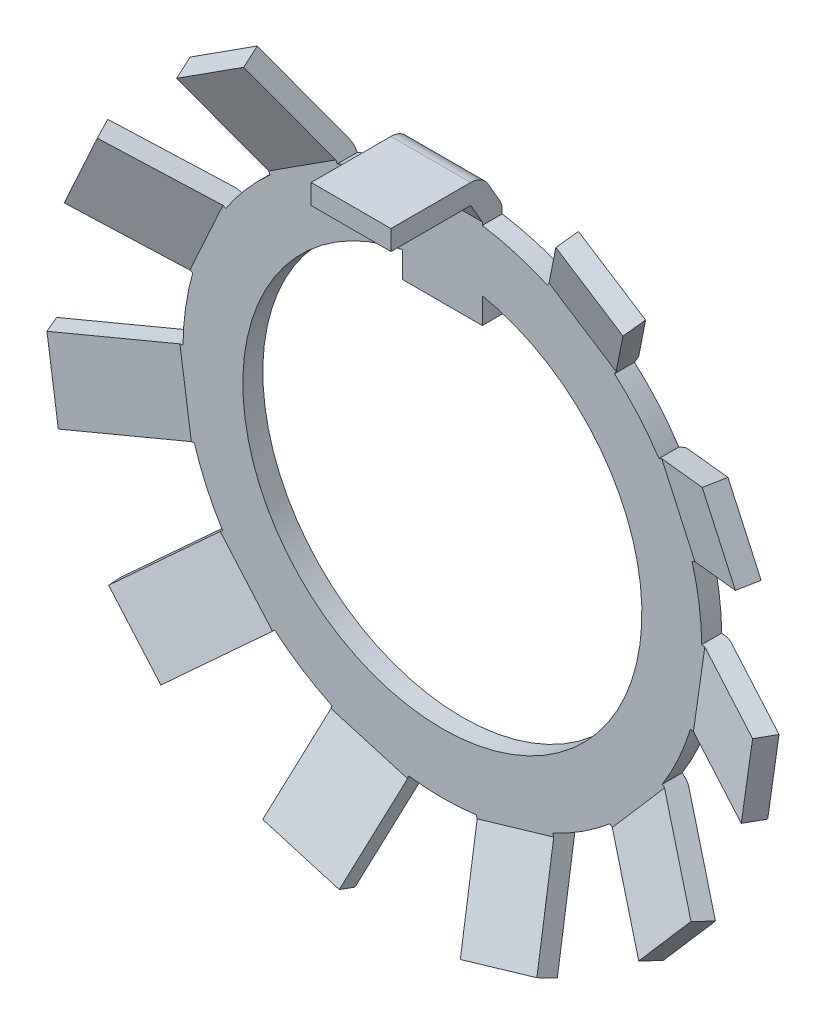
ISO-10303-21;
HEADER;
FILE_DESCRIPTION(('STEP AP214'),'2;1');
FILE_NAME('part.step','',(''),(''),'','','');
FILE_SCHEMA(('AUTOMOTIVE_DESIGN { 1 0 10303 214 1 1 1 1 }'));
ENDSEC;
DATA;
#1=APPLICATION_CONTEXT('core data for automotive mechanical design processes');
#2=APPLICATION_PROTOCOL_DEFINITION('international standard','automotive_design',2000,#1);
#3=PRODUCT_CONTEXT('',#1,'mechanical');
#4=PRODUCT('Part','Part','',(#3));
#5=PRODUCT_RELATED_PRODUCT_CATEGORY('part','',(#4));
#6=PRODUCT_DEFINITION_FORMATION('','',#4);
#7=PRODUCT_DEFINITION_CONTEXT('part definition',#1,'design');
#8=PRODUCT_DEFINITION('design','',#6,#7);
#9=PRODUCT_DEFINITION_SHAPE('','',#8);
#10=(LENGTH_UNIT() NAMED_UNIT(*) SI_UNIT(.MILLI.,.METRE.));
#11=(NAMED_UNIT(*) PLANE_ANGLE_UNIT() SI_UNIT($,.RADIAN.));
#12=(NAMED_UNIT(*) SI_UNIT($,.STERADIAN.) SOLID_ANGLE_UNIT());
#13=UNCERTAINTY_MEASURE_WITH_UNIT(LENGTH_MEASURE(1.E-05),#10,'distance_accuracy_value','');
#14=(GEOMETRIC_REPRESENTATION_CONTEXT(3) GLOBAL_UNCERTAINTY_ASSIGNED_CONTEXT((#13)) GLOBAL_UNIT_ASSIGNED_CONTEXT((#10,
#11,#12)) REPRESENTATION_CONTEXT('',''));
#15=CARTESIAN_POINT('',(0.,0.,0.));
#16=DIRECTION('',(0.,0.,1.));
#17=DIRECTION('',(1.,0.,0.));
#18=AXIS2_PLACEMENT_3D('',#15,#16,#17);
#19=CARTESIAN_POINT('',(0.,0.,1.));
#20=DIRECTION('',(0.,0.,-1.));
#21=DIRECTION('',(-1.,0.,0.));
#22=AXIS2_PLACEMENT_3D('',#19,#20,#21);
#23=CYLINDRICAL_SURFACE('',#22,13.);
#24=DIRECTION('',(0.,0.,-1.));
#25=VECTOR('',#24,1.);
#26=CARTESIAN_POINT('',(-2.,12.8452325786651,1.));
#27=LINE('',#26,#25);
#28=CARTESIAN_POINT('',(-2.,12.8452325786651,0.));
#29=VERTEX_POINT('',#28);
#30=CARTESIAN_POINT('',(-2.,12.8452325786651,1.));
#31=VERTEX_POINT('',#30);
#32=EDGE_CURVE('E54',#29,#31,#27,.F.);
#33=ORIENTED_EDGE('',*,*,#32,.F.);
#34=CARTESIAN_POINT('',(0.,0.,0.));
#35=DIRECTION('',(0.,0.,1.));
#36=DIRECTION('',(1.,0.,0.));
#37=AXIS2_PLACEMENT_3D('',#34,#35,#36);
#38=CIRCLE('',#37,13.);
#39=CARTESIAN_POINT('',(-5.26214997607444,11.8873789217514,0.));
#40=VERTEX_POINT('',#39);
#41=EDGE_CURVE('E1121',#29,#40,#38,.T.);
#42=ORIENTED_EDGE('',*,*,#41,.T.);
#43=DIRECTION('',(0.,0.,-1.));
#44=VECTOR('',#43,1.);
#45=CARTESIAN_POINT('',(-5.26214997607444,11.8873789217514,1.));
#46=LINE('',#45,#44);
#47=CARTESIAN_POINT('',(-5.26214997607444,11.8873789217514,1.));
#48=VERTEX_POINT('',#47);
#49=EDGE_CURVE('E1133',#40,#48,#46,.F.);
#50=ORIENTED_EDGE('',*,*,#49,.T.);
#51=CARTESIAN_POINT('',(0.,0.,1.));
#52=DIRECTION('',(0.,0.,1.));
#53=DIRECTION('',(1.,0.,0.));
#54=AXIS2_PLACEMENT_3D('',#51,#52,#53);
#55=CIRCLE('',#54,13.);
#56=EDGE_CURVE('E1124',#31,#48,#55,.T.);
#57=ORIENTED_EDGE('',*,*,#56,.F.);
#58=EDGE_LOOP('',(#33,#42,#50,#57));
#59=FACE_BOUND('',#58,.T.);
#60=ADVANCED_FACE('F31',(#59),#23,.T.);
#61=CARTESIAN_POINT('',(5.26214997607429,11.8873789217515,0.));
#62=VERTEX_POINT('',#61);
#63=CARTESIAN_POINT('',(2.,12.8452325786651,0.));
#64=VERTEX_POINT('',#63);
#65=EDGE_CURVE('E1203',#62,#64,#38,.T.);
#66=ORIENTED_EDGE('',*,*,#65,.T.);
#67=DIRECTION('',(0.,0.,-1.));
#68=VECTOR('',#67,1.);
#69=CARTESIAN_POINT('',(2.,12.8452325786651,1.));
#70=LINE('',#69,#68);
#71=CARTESIAN_POINT('',(2.,12.8452325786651,1.));
#72=VERTEX_POINT('',#71);
#73=EDGE_CURVE('E46',#64,#72,#70,.F.);
#74=ORIENTED_EDGE('',*,*,#73,.T.);
#75=CARTESIAN_POINT('',(5.26214997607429,11.8873789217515,1.));
#76=VERTEX_POINT('',#75);
#77=EDGE_CURVE('E1986',#76,#72,#55,.T.);
#78=ORIENTED_EDGE('',*,*,#77,.F.);
#79=DIRECTION('',(0.,0.,-1.));
#80=VECTOR('',#79,1.);
#81=CARTESIAN_POINT('',(5.26214997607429,11.8873789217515,1.));
#82=LINE('',#81,#80);
#83=EDGE_CURVE('E672',#62,#76,#82,.F.);
#84=ORIENTED_EDGE('',*,*,#83,.F.);
#85=EDGE_LOOP('',(#66,#74,#78,#84));
#86=FACE_BOUND('',#85,.T.);
#87=ADVANCED_FACE('F1251',(#86),#23,.T.);
#88=CARTESIAN_POINT('',(10.8536045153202,7.15536644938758,0.));
#89=VERTEX_POINT('',#88);
#90=CARTESIAN_POINT('',(8.62716410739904,9.72481565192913,0.));
#91=VERTEX_POINT('',#90);
#92=EDGE_CURVE('E1199',#89,#91,#38,.T.);
#93=ORIENTED_EDGE('',*,*,#92,.T.);
#94=DIRECTION('',(0.,0.,-1.));
#95=VECTOR('',#94,1.);
#96=CARTESIAN_POINT('',(8.62716410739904,9.72481565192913,1.));
#97=LINE('',#96,#95);
#98=CARTESIAN_POINT('',(8.62716410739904,9.72481565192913,1.));
#99=VERTEX_POINT('',#98);
#100=EDGE_CURVE('E675',#91,#99,#97,.F.);
#101=ORIENTED_EDGE('',*,*,#100,.T.);
#102=CARTESIAN_POINT('',(10.8536045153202,7.15536644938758,1.));
#103=VERTEX_POINT('',#102);
#104=EDGE_CURVE('E1982',#103,#99,#55,.T.);
#105=ORIENTED_EDGE('',*,*,#104,.F.);
#106=DIRECTION('',(0.,0.,-1.));
#107=VECTOR('',#106,1.);
#108=CARTESIAN_POINT('',(10.8536045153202,7.15536644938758,1.));
#109=LINE('',#108,#107);
#110=EDGE_CURVE('E719',#89,#103,#109,.F.);
#111=ORIENTED_EDGE('',*,*,#110,.F.);
#112=EDGE_LOOP('',(#93,#101,#105,#111));
#113=FACE_BOUND('',#112,.T.);
#114=ADVANCED_FACE('F1278',(#113),#23,.T.);
#115=CARTESIAN_POINT('',(12.9991163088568,0.15157568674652,0.));
#116=VERTEX_POINT('',#115);
#117=CARTESIAN_POINT('',(12.5152645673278,3.51683846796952,0.));
#118=VERTEX_POINT('',#117);
#119=EDGE_CURVE('E1195',#116,#118,#38,.T.);
#120=ORIENTED_EDGE('',*,*,#119,.T.);
#121=DIRECTION('',(0.,0.,-1.));
#122=VECTOR('',#121,1.);
#123=CARTESIAN_POINT('',(12.5152645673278,3.51683846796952,1.));
#124=LINE('',#123,#122);
#125=CARTESIAN_POINT('',(12.5152645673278,3.51683846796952,1.));
#126=VERTEX_POINT('',#125);
#127=EDGE_CURVE('E722',#118,#126,#124,.F.);
#128=ORIENTED_EDGE('',*,*,#127,.T.);
#129=CARTESIAN_POINT('',(12.9991163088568,0.15157568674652,1.));
#130=VERTEX_POINT('',#129);
#131=EDGE_CURVE('E1978',#130,#126,#55,.T.);
#132=ORIENTED_EDGE('',*,*,#131,.F.);
#133=DIRECTION('',(0.,0.,-1.));
#134=VECTOR('',#133,1.);
#135=CARTESIAN_POINT('',(12.9991163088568,0.15157568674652,1.));
#136=LINE('',#135,#134);
#137=EDGE_CURVE('E766',#116,#130,#136,.F.);
#138=ORIENTED_EDGE('',*,*,#137,.F.);
#139=EDGE_LOOP('',(#120,#128,#132,#138));
#140=FACE_BOUND('',#139,.T.);
#141=ADVANCED_FACE('F1274',(#140),#23,.T.);
#142=CARTESIAN_POINT('',(11.0175005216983,-6.90033928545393,0.));
#143=VERTEX_POINT('',#142);
#144=CARTESIAN_POINT('',(12.4298569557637,-3.80771008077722,0.));
#145=VERTEX_POINT('',#144);
#146=EDGE_CURVE('E1191',#143,#145,#38,.T.);
#147=ORIENTED_EDGE('',*,*,#146,.T.);
#148=DIRECTION('',(0.,0.,-1.));
#149=VECTOR('',#148,1.);
#150=CARTESIAN_POINT('',(12.4298569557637,-3.80771008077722,1.));
#151=LINE('',#150,#149);
#152=CARTESIAN_POINT('',(12.4298569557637,-3.80771008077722,1.));
#153=VERTEX_POINT('',#152);
#154=EDGE_CURVE('E769',#145,#153,#151,.F.);
#155=ORIENTED_EDGE('',*,*,#154,.T.);
#156=CARTESIAN_POINT('',(11.0175005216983,-6.90033928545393,1.));
#157=VERTEX_POINT('',#156);
#158=EDGE_CURVE('E1974',#157,#153,#55,.T.);
#159=ORIENTED_EDGE('',*,*,#158,.F.);
#160=DIRECTION('',(0.,0.,-1.));
#161=VECTOR('',#160,1.);
#162=CARTESIAN_POINT('',(11.0175005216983,-6.90033928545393,1.));
#163=LINE('',#162,#161);
#164=EDGE_CURVE('E813',#143,#157,#163,.F.);
#165=ORIENTED_EDGE('',*,*,#164,.F.);
#166=EDGE_LOOP('',(#147,#155,#159,#165));
#167=FACE_BOUND('',#166,.T.);
#168=ADVANCED_FACE('F1270',(#167),#23,.T.);
#169=CARTESIAN_POINT('',(5.53790616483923,-11.7614452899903,0.));
#170=VERTEX_POINT('',#169);
#171=CARTESIAN_POINT('',(8.39805758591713,-9.92333758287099,0.));
#172=VERTEX_POINT('',#171);
#173=EDGE_CURVE('E1187',#170,#172,#38,.T.);
#174=ORIENTED_EDGE('',*,*,#173,.T.);
#175=DIRECTION('',(0.,0.,-1.));
#176=VECTOR('',#175,1.);
#177=CARTESIAN_POINT('',(8.39805758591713,-9.92333758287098,1.));
#178=LINE('',#177,#176);
#179=CARTESIAN_POINT('',(8.39805758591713,-9.92333758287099,1.));
#180=VERTEX_POINT('',#179);
#181=EDGE_CURVE('E816',#172,#180,#178,.F.);
#182=ORIENTED_EDGE('',*,*,#181,.T.);
#183=CARTESIAN_POINT('',(5.53790616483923,-11.7614452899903,1.));
#184=VERTEX_POINT('',#183);
#185=EDGE_CURVE('E1970',#184,#180,#55,.T.);
#186=ORIENTED_EDGE('',*,*,#185,.F.);
#187=DIRECTION('',(0.,0.,-1.));
#188=VECTOR('',#187,1.);
#189=CARTESIAN_POINT('',(5.53790616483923,-11.7614452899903,1.));
#190=LINE('',#189,#188);
#191=EDGE_CURVE('E860',#170,#184,#190,.F.);
#192=ORIENTED_EDGE('',*,*,#191,.F.);
#193=EDGE_LOOP('',(#174,#182,#186,#192));
#194=FACE_BOUND('',#193,.T.);
#195=ADVANCED_FACE('F1266',(#194),#23,.T.);
#196=CARTESIAN_POINT('',(-1.69993427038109,-12.8883755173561,0.));
#197=VERTEX_POINT('',#196);
#198=CARTESIAN_POINT('',(1.69993427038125,-12.8883755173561,0.));
#199=VERTEX_POINT('',#198);
#200=EDGE_CURVE('E1183',#197,#199,#38,.T.);
#201=ORIENTED_EDGE('',*,*,#200,.T.);
#202=DIRECTION('',(0.,0.,-1.));
#203=VECTOR('',#202,1.);
#204=CARTESIAN_POINT('',(1.69993427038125,-12.8883755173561,1.));
#205=LINE('',#204,#203);
#206=CARTESIAN_POINT('',(1.69993427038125,-12.8883755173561,1.));
#207=VERTEX_POINT('',#206);
#208=EDGE_CURVE('E863',#199,#207,#205,.F.);
#209=ORIENTED_EDGE('',*,*,#208,.T.);
#210=CARTESIAN_POINT('',(-1.69993427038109,-12.8883755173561,1.));
#211=VERTEX_POINT('',#210);
#212=EDGE_CURVE('E1966',#211,#207,#55,.T.);
#213=ORIENTED_EDGE('',*,*,#212,.F.);
#214=DIRECTION('',(0.,0.,-1.));
#215=VECTOR('',#214,1.);
#216=CARTESIAN_POINT('',(-1.69993427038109,-12.8883755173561,1.));
#217=LINE('',#216,#215);
#218=EDGE_CURVE('E907',#197,#211,#217,.F.);
#219=ORIENTED_EDGE('',*,*,#218,.F.);
#220=EDGE_LOOP('',(#201,#209,#213,#219));
#221=FACE_BOUND('',#220,.T.);
#222=ADVANCED_FACE('F1262',(#221),#23,.T.);
#223=CARTESIAN_POINT('',(-8.39805758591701,-9.92333758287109,0.));
#224=VERTEX_POINT('',#223);
#225=CARTESIAN_POINT('',(-5.53790616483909,-11.7614452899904,0.));
#226=VERTEX_POINT('',#225);
#227=EDGE_CURVE('E1179',#224,#226,#38,.T.);
#228=ORIENTED_EDGE('',*,*,#227,.T.);
#229=DIRECTION('',(0.,0.,-1.));
#230=VECTOR('',#229,1.);
#231=CARTESIAN_POINT('',(-5.53790616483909,-11.7614452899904,1.));
#232=LINE('',#231,#230);
#233=CARTESIAN_POINT('',(-5.53790616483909,-11.7614452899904,1.));
#234=VERTEX_POINT('',#233);
#235=EDGE_CURVE('E910',#226,#234,#232,.F.);
#236=ORIENTED_EDGE('',*,*,#235,.T.);
#237=CARTESIAN_POINT('',(-8.39805758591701,-9.92333758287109,1.));
#238=VERTEX_POINT('',#237);
#239=EDGE_CURVE('E1964',#238,#234,#55,.T.);
#240=ORIENTED_EDGE('',*,*,#239,.F.);
#241=DIRECTION('',(0.,0.,-1.));
#242=VECTOR('',#241,1.);
#243=CARTESIAN_POINT('',(-8.39805758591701,-9.92333758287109,1.));
#244=LINE('',#243,#242);
#245=EDGE_CURVE('E954',#224,#238,#244,.F.);
#246=ORIENTED_EDGE('',*,*,#245,.F.);
#247=EDGE_LOOP('',(#228,#236,#240,#246));
#248=FACE_BOUND('',#247,.T.);
#249=ADVANCED_FACE('F1258',(#248),#23,.T.);
#250=CARTESIAN_POINT('',(-12.4298569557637,-3.80771008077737,0.));
#251=VERTEX_POINT('',#250);
#252=CARTESIAN_POINT('',(-11.0175005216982,-6.90033928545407,0.));
#253=VERTEX_POINT('',#252);
#254=EDGE_CURVE('E1178',#251,#253,#38,.T.);
#255=ORIENTED_EDGE('',*,*,#254,.T.);
#256=DIRECTION('',(0.,0.,-1.));
#257=VECTOR('',#256,1.);
#258=CARTESIAN_POINT('',(-11.0175005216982,-6.90033928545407,1.));
#259=LINE('',#258,#257);
#260=CARTESIAN_POINT('',(-11.0175005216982,-6.90033928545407,1.));
#261=VERTEX_POINT('',#260);
#262=EDGE_CURVE('E957',#253,#261,#259,.F.);
#263=ORIENTED_EDGE('',*,*,#262,.T.);
#264=CARTESIAN_POINT('',(-12.4298569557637,-3.80771008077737,1.));
#265=VERTEX_POINT('',#264);
#266=EDGE_CURVE('E1956',#265,#261,#55,.T.);
#267=ORIENTED_EDGE('',*,*,#266,.F.);
#268=DIRECTION('',(0.,0.,-1.));
#269=VECTOR('',#268,1.);
#270=CARTESIAN_POINT('',(-12.4298569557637,-3.80771008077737,1.));
#271=LINE('',#270,#269);
#272=EDGE_CURVE('E1001',#251,#265,#271,.F.);
#273=ORIENTED_EDGE('',*,*,#272,.F.);
#274=EDGE_LOOP('',(#255,#263,#267,#273));
#275=FACE_BOUND('',#274,.T.);
#276=ADVANCED_FACE('F1253',(#275),#23,.T.);
#277=CARTESIAN_POINT('',(-12.5152645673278,3.51683846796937,0.));
#278=VERTEX_POINT('',#277);
#279=CARTESIAN_POINT('',(-12.9991163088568,0.15157568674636,0.));
#280=VERTEX_POINT('',#279);
#281=EDGE_CURVE('E1125',#278,#280,#38,.T.);
#282=ORIENTED_EDGE('',*,*,#281,.T.);
#283=DIRECTION('',(0.,0.,-1.));
#284=VECTOR('',#283,1.);
#285=CARTESIAN_POINT('',(-12.9991163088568,0.15157568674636,1.));
#286=LINE('',#285,#284);
#287=CARTESIAN_POINT('',(-12.9991163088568,0.15157568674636,1.));
#288=VERTEX_POINT('',#287);
#289=EDGE_CURVE('E1004',#280,#288,#286,.F.);
#290=ORIENTED_EDGE('',*,*,#289,.T.);
#291=CARTESIAN_POINT('',(-12.5152645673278,3.51683846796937,1.));
#292=VERTEX_POINT('',#291);
#293=EDGE_CURVE('E1130',#292,#288,#55,.T.);
#294=ORIENTED_EDGE('',*,*,#293,.F.);
#295=DIRECTION('',(0.,0.,-1.));
#296=VECTOR('',#295,1.);
#297=CARTESIAN_POINT('',(-12.5152645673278,3.51683846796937,1.));
#298=LINE('',#297,#296);
#299=EDGE_CURVE('E39',#278,#292,#298,.F.);
#300=ORIENTED_EDGE('',*,*,#299,.F.);
#301=EDGE_LOOP('',(#282,#290,#294,#300));
#302=FACE_BOUND('',#301,.T.);
#303=ADVANCED_FACE('F1241',(#302),#23,.T.);
#304=CARTESIAN_POINT('',(0.,0.,1.));
#305=DIRECTION('',(0.,0.,1.));
#306=DIRECTION('',(1.,0.,0.));
#307=AXIS2_PLACEMENT_3D('',#304,#305,#306);
#308=PLANE('',#307);
#309=ORIENTED_EDGE('',*,*,#77,.T.);
#310=DIRECTION('',(0.,1.,0.));
#311=VECTOR('',#310,1.);
#312=CARTESIAN_POINT('',(2.,10.,1.));
#313=LINE('',#312,#311);
#314=CARTESIAN_POINT('',(2.,13.,1.));
#315=VERTEX_POINT('',#314);
#316=EDGE_CURVE('E604',#72,#315,#313,.T.);
#317=ORIENTED_EDGE('',*,*,#316,.T.);
#318=DIRECTION('',(-1.,0.,0.));
#319=VECTOR('',#318,1.);
#320=CARTESIAN_POINT('',(2.,13.,1.));
#321=LINE('',#320,#319);
#322=CARTESIAN_POINT('',(-2.,13.,1.));
#323=VERTEX_POINT('',#322);
#324=EDGE_CURVE('E623',#315,#323,#321,.T.);
#325=ORIENTED_EDGE('',*,*,#324,.T.);
#326=DIRECTION('',(0.,1.,0.));
#327=VECTOR('',#326,1.);
#328=CARTESIAN_POINT('',(-2.,10.,1.));
#329=LINE('',#328,#327);
#330=EDGE_CURVE('E583',#31,#323,#329,.T.);
#331=ORIENTED_EDGE('',*,*,#330,.F.);
#332=ORIENTED_EDGE('',*,*,#56,.T.);
#333=DIRECTION('',(-0.540640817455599,0.841253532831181,0.));
#334=VECTOR('',#333,1.);
#335=CARTESIAN_POINT('',(-3.72390110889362,9.493816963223,1.));
#336=LINE('',#335,#334);
#337=CARTESIAN_POINT('',(-5.34582356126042,12.0175775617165,1.));
#338=VERTEX_POINT('',#337);
#339=EDGE_CURVE('E1073',#48,#338,#336,.T.);
#340=ORIENTED_EDGE('',*,*,#339,.T.);
#341=DIRECTION('',(-0.841253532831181,-0.540640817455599,0.));
#342=VECTOR('',#341,1.);
#343=CARTESIAN_POINT('',(-5.34582356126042,12.0175775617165,1.));
#344=LINE('',#343,#342);
#345=CARTESIAN_POINT('',(-8.71083769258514,9.85501429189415,1.));
#346=VERTEX_POINT('',#345);
#347=EDGE_CURVE('E1084',#338,#346,#344,.T.);
#348=ORIENTED_EDGE('',*,*,#347,.T.);
#349=DIRECTION('',(-0.540640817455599,0.841253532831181,0.));
#350=VECTOR('',#349,1.);
#351=CARTESIAN_POINT('',(-7.08891524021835,7.33125369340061,1.));
#352=LINE('',#351,#350);
#353=CARTESIAN_POINT('',(-8.62716410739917,9.72481565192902,1.));
#354=VERTEX_POINT('',#353);
#355=EDGE_CURVE('E1057',#354,#346,#352,.T.);
#356=ORIENTED_EDGE('',*,*,#355,.F.);
#357=CARTESIAN_POINT('',(-10.8536045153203,7.15536644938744,1.));
#358=VERTEX_POINT('',#357);
#359=EDGE_CURVE('E1126',#354,#358,#55,.T.);
#360=ORIENTED_EDGE('',*,*,#359,.T.);
#361=DIRECTION('',(-0.909631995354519,0.415415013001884,0.));
#362=VECTOR('',#361,1.);
#363=CARTESIAN_POINT('',(-8.26548992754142,5.97341412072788,1.));
#364=LINE('',#363,#362);
#365=CARTESIAN_POINT('',(-10.994385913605,7.21965915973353,1.));
#366=VERTEX_POINT('',#365);
#367=EDGE_CURVE('E1031',#358,#366,#364,.T.);
#368=ORIENTED_EDGE('',*,*,#367,.T.);
#369=DIRECTION('',(-0.415415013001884,-0.909631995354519,0.));
#370=VECTOR('',#369,1.);
#371=CARTESIAN_POINT('',(-10.994385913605,7.21965915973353,1.));
#372=LINE('',#371,#370);
#373=CARTESIAN_POINT('',(-12.6560459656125,3.58113117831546,1.));
#374=VERTEX_POINT('',#373);
#375=EDGE_CURVE('E1042',#366,#374,#372,.T.);
#376=ORIENTED_EDGE('',*,*,#375,.T.);
#377=DIRECTION('',(-0.909631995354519,0.415415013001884,0.));
#378=VECTOR('',#377,1.);
#379=CARTESIAN_POINT('',(-9.92714997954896,2.3348861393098,1.));
#380=LINE('',#379,#378);
#381=EDGE_CURVE('E1015',#292,#374,#380,.T.);
#382=ORIENTED_EDGE('',*,*,#381,.F.);
#383=ORIENTED_EDGE('',*,*,#293,.T.);
#384=DIRECTION('',(-0.989821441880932,-0.142314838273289,0.));
#385=VECTOR('',#384,1.);
#386=CARTESIAN_POINT('',(-10.1828440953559,0.55649450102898,1.));
#387=LINE('',#386,#385);
#388=CARTESIAN_POINT('',(-13.1523084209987,0.129549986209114,1.));
#389=VERTEX_POINT('',#388);
#390=EDGE_CURVE('E984',#288,#389,#387,.T.);
#391=ORIENTED_EDGE('',*,*,#390,.T.);
#392=DIRECTION('',(0.142314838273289,-0.989821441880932,0.));
#393=VECTOR('',#392,1.);
#394=CARTESIAN_POINT('',(-13.1523084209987,0.129549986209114,1.));
#395=LINE('',#394,#393);
#396=CARTESIAN_POINT('',(-12.5830490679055,-3.82973578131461,1.));
#397=VERTEX_POINT('',#396);
#398=EDGE_CURVE('E995',#389,#397,#395,.T.);
#399=ORIENTED_EDGE('',*,*,#398,.T.);
#400=DIRECTION('',(-0.989821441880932,-0.142314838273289,0.));
#401=VECTOR('',#400,1.);
#402=CARTESIAN_POINT('',(-9.61358474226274,-3.40279126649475,1.));
#403=LINE('',#402,#401);
#404=EDGE_CURVE('E968',#265,#397,#403,.T.);
#405=ORIENTED_EDGE('',*,*,#404,.F.);
#406=ORIENTED_EDGE('',*,*,#266,.T.);
#407=DIRECTION('',(-0.755749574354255,-0.654860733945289,0.));
#408=VECTOR('',#407,1.);
#409=CARTESIAN_POINT('',(-8.86721721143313,-5.03710819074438,1.));
#410=LINE('',#409,#408);
#411=CARTESIAN_POINT('',(-11.1344659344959,-7.00169039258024,1.));
#412=VERTEX_POINT('',#411);
#413=EDGE_CURVE('E937',#261,#412,#410,.T.);
#414=ORIENTED_EDGE('',*,*,#413,.T.);
#415=DIRECTION('',(0.654860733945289,-0.755749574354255,0.));
#416=VECTOR('',#415,1.);
#417=CARTESIAN_POINT('',(-11.1344659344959,-7.00169039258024,1.));
#418=LINE('',#417,#416);
#419=CARTESIAN_POINT('',(-8.51502299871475,-10.0246886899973,1.));
#420=VERTEX_POINT('',#419);
#421=EDGE_CURVE('E948',#412,#420,#418,.T.);
#422=ORIENTED_EDGE('',*,*,#421,.T.);
#423=DIRECTION('',(-0.755749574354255,-0.654860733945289,0.));
#424=VECTOR('',#423,1.);
#425=CARTESIAN_POINT('',(-6.24777427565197,-8.0601064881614,1.));
#426=LINE('',#425,#424);
#427=EDGE_CURVE('E921',#238,#420,#426,.T.);
#428=ORIENTED_EDGE('',*,*,#427,.F.);
#429=ORIENTED_EDGE('',*,*,#239,.T.);
#430=DIRECTION('',(-0.281732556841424,-0.959492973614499,0.));
#431=VECTOR('',#430,1.);
#432=CARTESIAN_POINT('',(-4.73631151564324,-9.03146462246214,1.));
#433=LINE('',#432,#431);
#434=CARTESIAN_POINT('',(-5.58150918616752,-11.9099435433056,1.));
#435=VERTEX_POINT('',#434);
#436=EDGE_CURVE('E890',#234,#435,#433,.T.);
#437=ORIENTED_EDGE('',*,*,#436,.T.);
#438=DIRECTION('',(0.959492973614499,-0.281732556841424,0.));
#439=VECTOR('',#438,1.);
#440=CARTESIAN_POINT('',(-5.58150918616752,-11.9099435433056,1.));
#441=LINE('',#440,#439);
#442=CARTESIAN_POINT('',(-1.74353729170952,-13.0368737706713,1.));
#443=VERTEX_POINT('',#442);
#444=EDGE_CURVE('E901',#435,#443,#441,.T.);
#445=ORIENTED_EDGE('',*,*,#444,.T.);
#446=DIRECTION('',(-0.281732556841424,-0.959492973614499,0.));
#447=VECTOR('',#446,1.);
#448=CARTESIAN_POINT('',(-0.898339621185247,-10.1583948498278,1.));
#449=LINE('',#448,#447);
#450=EDGE_CURVE('E874',#211,#443,#449,.T.);
#451=ORIENTED_EDGE('',*,*,#450,.F.);
#452=ORIENTED_EDGE('',*,*,#212,.T.);
#453=DIRECTION('',(0.281732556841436,-0.959492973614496,0.));
#454=VECTOR('',#453,1.);
#455=CARTESIAN_POINT('',(0.898339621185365,-10.1583948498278,1.));
#456=LINE('',#455,#454);
#457=CARTESIAN_POINT('',(1.74353729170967,-13.0368737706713,1.));
#458=VERTEX_POINT('',#457);
#459=EDGE_CURVE('E843',#207,#458,#456,.T.);
#460=ORIENTED_EDGE('',*,*,#459,.T.);
#461=DIRECTION('',(0.959492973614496,0.281732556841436,0.));
#462=VECTOR('',#461,1.);
#463=CARTESIAN_POINT('',(1.74353729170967,-13.0368737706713,1.));
#464=LINE('',#463,#462);
#465=CARTESIAN_POINT('',(5.58150918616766,-11.9099435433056,1.));
#466=VERTEX_POINT('',#465);
#467=EDGE_CURVE('E854',#458,#466,#464,.T.);
#468=ORIENTED_EDGE('',*,*,#467,.T.);
#469=DIRECTION('',(0.281732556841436,-0.959492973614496,0.));
#470=VECTOR('',#469,1.);
#471=CARTESIAN_POINT('',(4.73631151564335,-9.03146462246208,1.));
#472=LINE('',#471,#470);
#473=EDGE_CURVE('E827',#184,#466,#472,.T.);
#474=ORIENTED_EDGE('',*,*,#473,.F.);
#475=ORIENTED_EDGE('',*,*,#185,.T.);
#476=DIRECTION('',(0.755749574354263,-0.654860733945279,0.));
#477=VECTOR('',#476,1.);
#478=CARTESIAN_POINT('',(6.24777427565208,-8.06010648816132,1.));
#479=LINE('',#478,#477);
#480=CARTESIAN_POINT('',(8.51502299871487,-10.0246886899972,1.));
#481=VERTEX_POINT('',#480);
#482=EDGE_CURVE('E796',#180,#481,#479,.T.);
#483=ORIENTED_EDGE('',*,*,#482,.T.);
#484=DIRECTION('',(0.654860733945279,0.755749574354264,0.));
#485=VECTOR('',#484,1.);
#486=CARTESIAN_POINT('',(8.51502299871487,-10.0246886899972,1.));
#487=LINE('',#486,#485);
#488=CARTESIAN_POINT('',(11.134465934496,-7.0016903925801,1.));
#489=VERTEX_POINT('',#488);
#490=EDGE_CURVE('E807',#481,#489,#487,.T.);
#491=ORIENTED_EDGE('',*,*,#490,.T.);
#492=DIRECTION('',(0.755749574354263,-0.654860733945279,0.));
#493=VECTOR('',#492,1.);
#494=CARTESIAN_POINT('',(8.86721721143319,-5.03710819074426,1.));
#495=LINE('',#494,#493);
#496=EDGE_CURVE('E780',#157,#489,#495,.T.);
#497=ORIENTED_EDGE('',*,*,#496,.F.);
#498=ORIENTED_EDGE('',*,*,#158,.T.);
#499=DIRECTION('',(0.989821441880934,-0.142314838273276,0.));
#500=VECTOR('',#499,1.);
#501=CARTESIAN_POINT('',(9.61358474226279,-3.40279126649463,1.));
#502=LINE('',#501,#500);
#503=CARTESIAN_POINT('',(12.5830490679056,-3.82973578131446,1.));
#504=VERTEX_POINT('',#503);
#505=EDGE_CURVE('E749',#153,#504,#502,.T.);
#506=ORIENTED_EDGE('',*,*,#505,.T.);
#507=DIRECTION('',(0.142314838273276,0.989821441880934,0.));
#508=VECTOR('',#507,1.);
#509=CARTESIAN_POINT('',(12.5830490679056,-3.82973578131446,1.));
#510=LINE('',#509,#508);
#511=CARTESIAN_POINT('',(13.1523084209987,0.129549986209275,1.));
#512=VERTEX_POINT('',#511);
#513=EDGE_CURVE('E760',#504,#512,#510,.T.);
#514=ORIENTED_EDGE('',*,*,#513,.T.);
#515=DIRECTION('',(0.989821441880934,-0.142314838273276,0.));
#516=VECTOR('',#515,1.);
#517=CARTESIAN_POINT('',(10.1828440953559,0.556494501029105,1.));
#518=LINE('',#517,#516);
#519=EDGE_CURVE('E733',#130,#512,#518,.T.);
#520=ORIENTED_EDGE('',*,*,#519,.F.);
#521=ORIENTED_EDGE('',*,*,#131,.T.);
#522=DIRECTION('',(0.909631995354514,0.415415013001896,0.));
#523=VECTOR('',#522,1.);
#524=CARTESIAN_POINT('',(9.92714997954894,2.33488613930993,1.));
#525=LINE('',#524,#523);
#526=CARTESIAN_POINT('',(12.6560459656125,3.58113117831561,1.));
#527=VERTEX_POINT('',#526);
#528=EDGE_CURVE('E702',#126,#527,#525,.T.);
#529=ORIENTED_EDGE('',*,*,#528,.T.);
#530=DIRECTION('',(-0.415415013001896,0.909631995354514,0.));
#531=VECTOR('',#530,1.);
#532=CARTESIAN_POINT('',(12.6560459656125,3.58113117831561,1.));
#533=LINE('',#532,#531);
#534=CARTESIAN_POINT('',(10.9943859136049,7.21965915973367,1.));
#535=VERTEX_POINT('',#534);
#536=EDGE_CURVE('E713',#527,#535,#533,.T.);
#537=ORIENTED_EDGE('',*,*,#536,.T.);
#538=DIRECTION('',(0.909631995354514,0.415415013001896,0.));
#539=VECTOR('',#538,1.);
#540=CARTESIAN_POINT('',(8.26548992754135,5.97341412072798,1.));
#541=LINE('',#540,#539);
#542=EDGE_CURVE('E686',#103,#535,#541,.T.);
#543=ORIENTED_EDGE('',*,*,#542,.F.);
#544=ORIENTED_EDGE('',*,*,#104,.T.);
#545=DIRECTION('',(0.540640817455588,0.841253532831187,0.));
#546=VECTOR('',#545,1.);
#547=CARTESIAN_POINT('',(7.08891524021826,7.3312536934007,1.));
#548=LINE('',#547,#546);
#549=CARTESIAN_POINT('',(8.71083769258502,9.85501429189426,1.));
#550=VERTEX_POINT('',#549);
#551=EDGE_CURVE('E655',#99,#550,#548,.T.);
#552=ORIENTED_EDGE('',*,*,#551,.T.);
#553=DIRECTION('',(-0.841253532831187,0.540640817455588,0.));
#554=VECTOR('',#553,1.);
#555=CARTESIAN_POINT('',(8.71083769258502,9.85501429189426,1.));
#556=LINE('',#555,#554);
#557=CARTESIAN_POINT('',(5.34582356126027,12.0175775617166,1.));
#558=VERTEX_POINT('',#557);
#559=EDGE_CURVE('E666',#550,#558,#556,.T.);
#560=ORIENTED_EDGE('',*,*,#559,.T.);
#561=DIRECTION('',(0.540640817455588,0.841253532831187,0.));
#562=VECTOR('',#561,1.);
#563=CARTESIAN_POINT('',(3.72390110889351,9.49381696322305,1.));
#564=LINE('',#563,#562);
#565=EDGE_CURVE('E639',#76,#558,#564,.T.);
#566=ORIENTED_EDGE('',*,*,#565,.F.);
#567=EDGE_LOOP('',(#309,#317,#325,#331,#332,#340,#348,#356,#360,#368,#376,#382,#383,#391,#399,
#405,#406,#414,#422,#428,#429,#437,#445,#451,#452,#460,#468,#474,#475,#483,#491,#497,#498,#506,
#514,#520,#521,#529,#537,#543,#544,#552,#560,#566));
#568=FACE_BOUND('',#567,.T.);
#569=DIRECTION('',(0.,-1.,0.));
#570=VECTOR('',#569,1.);
#571=CARTESIAN_POINT('',(2.,8.5,1.));
#572=LINE('',#571,#570);
#573=CARTESIAN_POINT('',(2.,9.79795897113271,1.));
#574=VERTEX_POINT('',#573);
#575=CARTESIAN_POINT('',(2.,8.5,1.));
#576=VERTEX_POINT('',#575);
#577=EDGE_CURVE('E1105',#574,#576,#572,.T.);
#578=ORIENTED_EDGE('',*,*,#577,.F.);
#579=CARTESIAN_POINT('',(0.,0.,1.));
#580=DIRECTION('',(0.,0.,1.));
#581=DIRECTION('',(1.,0.,0.));
#582=AXIS2_PLACEMENT_3D('',#579,#580,#581);
#583=CIRCLE('',#582,10.);
#584=CARTESIAN_POINT('',(-2.,9.79795897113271,1.));
#585=VERTEX_POINT('',#584);
#586=EDGE_CURVE('E1103',#585,#574,#583,.T.);
#587=ORIENTED_EDGE('',*,*,#586,.F.);
#588=DIRECTION('',(0.,1.,0.));
#589=VECTOR('',#588,1.);
#590=CARTESIAN_POINT('',(-2.,8.5,1.));
#591=LINE('',#590,#589);
#592=CARTESIAN_POINT('',(-2.,8.5,1.));
#593=VERTEX_POINT('',#592);
#594=EDGE_CURVE('E1101',#593,#585,#591,.T.);
#595=ORIENTED_EDGE('',*,*,#594,.F.);
#596=DIRECTION('',(-1.,0.,0.));
#597=VECTOR('',#596,1.);
#598=CARTESIAN_POINT('',(-2.,8.5,1.));
#599=LINE('',#598,#597);
#600=EDGE_CURVE('E1108',#576,#593,#599,.T.);
#601=ORIENTED_EDGE('',*,*,#600,.F.);
#602=EDGE_LOOP('',(#578,#587,#595,#601));
#603=FACE_BOUND('',#602,.T.);
#604=ADVANCED_FACE('F1146',(#568,#603),#308,.T.);
#605=CARTESIAN_POINT('',(0.,0.,0.));
#606=DIRECTION('',(0.,0.,1.));
#607=DIRECTION('',(1.,0.,0.));
#608=AXIS2_PLACEMENT_3D('',#605,#606,#607);
#609=PLANE('',#608);
#610=DIRECTION('',(0.,1.,0.));
#611=VECTOR('',#610,1.);
#612=CARTESIAN_POINT('',(-2.,10.,0.));
#613=LINE('',#612,#611);
#614=CARTESIAN_POINT('',(-2.,13.,0.));
#615=VERTEX_POINT('',#614);
#616=EDGE_CURVE('E586',#29,#615,#613,.T.);
#617=ORIENTED_EDGE('',*,*,#616,.T.);
#618=DIRECTION('',(-1.,0.,0.));
#619=VECTOR('',#618,1.);
#620=CARTESIAN_POINT('',(2.,13.,0.));
#621=LINE('',#620,#619);
#622=CARTESIAN_POINT('',(2.,13.,0.));
#623=VERTEX_POINT('',#622);
#624=EDGE_CURVE('E621',#623,#615,#621,.T.);
#625=ORIENTED_EDGE('',*,*,#624,.F.);
#626=DIRECTION('',(0.,1.,0.));
#627=VECTOR('',#626,1.);
#628=CARTESIAN_POINT('',(2.,10.,0.));
#629=LINE('',#628,#627);
#630=EDGE_CURVE('E606',#64,#623,#629,.T.);
#631=ORIENTED_EDGE('',*,*,#630,.F.);
#632=ORIENTED_EDGE('',*,*,#65,.F.);
#633=DIRECTION('',(0.540640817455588,0.841253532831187,0.));
#634=VECTOR('',#633,1.);
#635=CARTESIAN_POINT('',(3.72390110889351,9.49381696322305,0.));
#636=LINE('',#635,#634);
#637=CARTESIAN_POINT('',(5.34582356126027,12.0175775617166,0.));
#638=VERTEX_POINT('',#637);
#639=EDGE_CURVE('E642',#62,#638,#636,.T.);
#640=ORIENTED_EDGE('',*,*,#639,.T.);
#641=DIRECTION('',(-0.841253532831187,0.540640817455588,0.));
#642=VECTOR('',#641,1.);
#643=CARTESIAN_POINT('',(8.71083769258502,9.85501429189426,0.));
#644=LINE('',#643,#642);
#645=CARTESIAN_POINT('',(8.71083769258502,9.85501429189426,0.));
#646=VERTEX_POINT('',#645);
#647=EDGE_CURVE('E664',#646,#638,#644,.T.);
#648=ORIENTED_EDGE('',*,*,#647,.F.);
#649=DIRECTION('',(0.540640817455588,0.841253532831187,0.));
#650=VECTOR('',#649,1.);
#651=CARTESIAN_POINT('',(7.08891524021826,7.3312536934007,0.));
#652=LINE('',#651,#650);
#653=EDGE_CURVE('E657',#91,#646,#652,.T.);
#654=ORIENTED_EDGE('',*,*,#653,.F.);
#655=ORIENTED_EDGE('',*,*,#92,.F.);
#656=DIRECTION('',(0.909631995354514,0.415415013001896,0.));
#657=VECTOR('',#656,1.);
#658=CARTESIAN_POINT('',(8.26548992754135,5.97341412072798,0.));
#659=LINE('',#658,#657);
#660=CARTESIAN_POINT('',(10.9943859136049,7.21965915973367,0.));
#661=VERTEX_POINT('',#660);
#662=EDGE_CURVE('E689',#89,#661,#659,.T.);
#663=ORIENTED_EDGE('',*,*,#662,.T.);
#664=DIRECTION('',(-0.415415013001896,0.909631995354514,0.));
#665=VECTOR('',#664,1.);
#666=CARTESIAN_POINT('',(12.6560459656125,3.58113117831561,0.));
#667=LINE('',#666,#665);
#668=CARTESIAN_POINT('',(12.6560459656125,3.58113117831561,0.));
#669=VERTEX_POINT('',#668);
#670=EDGE_CURVE('E711',#669,#661,#667,.T.);
#671=ORIENTED_EDGE('',*,*,#670,.F.);
#672=DIRECTION('',(0.909631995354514,0.415415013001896,0.));
#673=VECTOR('',#672,1.);
#674=CARTESIAN_POINT('',(9.92714997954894,2.33488613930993,0.));
#675=LINE('',#674,#673);
#676=EDGE_CURVE('E704',#118,#669,#675,.T.);
#677=ORIENTED_EDGE('',*,*,#676,.F.);
#678=ORIENTED_EDGE('',*,*,#119,.F.);
#679=DIRECTION('',(0.989821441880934,-0.142314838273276,0.));
#680=VECTOR('',#679,1.);
#681=CARTESIAN_POINT('',(10.1828440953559,0.556494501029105,0.));
#682=LINE('',#681,#680);
#683=CARTESIAN_POINT('',(13.1523084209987,0.129549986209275,0.));
#684=VERTEX_POINT('',#683);
#685=EDGE_CURVE('E736',#116,#684,#682,.T.);
#686=ORIENTED_EDGE('',*,*,#685,.T.);
#687=DIRECTION('',(0.142314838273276,0.989821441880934,0.));
#688=VECTOR('',#687,1.);
#689=CARTESIAN_POINT('',(12.5830490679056,-3.82973578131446,0.));
#690=LINE('',#689,#688);
#691=CARTESIAN_POINT('',(12.5830490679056,-3.82973578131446,0.));
#692=VERTEX_POINT('',#691);
#693=EDGE_CURVE('E758',#692,#684,#690,.T.);
#694=ORIENTED_EDGE('',*,*,#693,.F.);
#695=DIRECTION('',(0.989821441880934,-0.142314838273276,0.));
#696=VECTOR('',#695,1.);
#697=CARTESIAN_POINT('',(9.61358474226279,-3.40279126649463,0.));
#698=LINE('',#697,#696);
#699=EDGE_CURVE('E751',#145,#692,#698,.T.);
#700=ORIENTED_EDGE('',*,*,#699,.F.);
#701=ORIENTED_EDGE('',*,*,#146,.F.);
#702=DIRECTION('',(0.755749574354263,-0.654860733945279,0.));
#703=VECTOR('',#702,1.);
#704=CARTESIAN_POINT('',(8.86721721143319,-5.03710819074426,0.));
#705=LINE('',#704,#703);
#706=CARTESIAN_POINT('',(11.134465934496,-7.0016903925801,0.));
#707=VERTEX_POINT('',#706);
#708=EDGE_CURVE('E783',#143,#707,#705,.T.);
#709=ORIENTED_EDGE('',*,*,#708,.T.);
#710=DIRECTION('',(0.654860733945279,0.755749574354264,0.));
#711=VECTOR('',#710,1.);
#712=CARTESIAN_POINT('',(8.51502299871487,-10.0246886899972,0.));
#713=LINE('',#712,#711);
#714=CARTESIAN_POINT('',(8.51502299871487,-10.0246886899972,0.));
#715=VERTEX_POINT('',#714);
#716=EDGE_CURVE('E805',#715,#707,#713,.T.);
#717=ORIENTED_EDGE('',*,*,#716,.F.);
#718=DIRECTION('',(0.755749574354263,-0.654860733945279,0.));
#719=VECTOR('',#718,1.);
#720=CARTESIAN_POINT('',(6.24777427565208,-8.06010648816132,0.));
#721=LINE('',#720,#719);
#722=EDGE_CURVE('E798',#172,#715,#721,.T.);
#723=ORIENTED_EDGE('',*,*,#722,.F.);
#724=ORIENTED_EDGE('',*,*,#173,.F.);
#725=DIRECTION('',(0.281732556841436,-0.959492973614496,0.));
#726=VECTOR('',#725,1.);
#727=CARTESIAN_POINT('',(4.73631151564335,-9.03146462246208,0.));
#728=LINE('',#727,#726);
#729=CARTESIAN_POINT('',(5.58150918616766,-11.9099435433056,0.));
#730=VERTEX_POINT('',#729);
#731=EDGE_CURVE('E830',#170,#730,#728,.T.);
#732=ORIENTED_EDGE('',*,*,#731,.T.);
#733=DIRECTION('',(0.959492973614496,0.281732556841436,0.));
#734=VECTOR('',#733,1.);
#735=CARTESIAN_POINT('',(1.74353729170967,-13.0368737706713,0.));
#736=LINE('',#735,#734);
#737=CARTESIAN_POINT('',(1.74353729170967,-13.0368737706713,0.));
#738=VERTEX_POINT('',#737);
#739=EDGE_CURVE('E852',#738,#730,#736,.T.);
#740=ORIENTED_EDGE('',*,*,#739,.F.);
#741=DIRECTION('',(0.281732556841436,-0.959492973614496,0.));
#742=VECTOR('',#741,1.);
#743=CARTESIAN_POINT('',(0.898339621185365,-10.1583948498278,0.));
#744=LINE('',#743,#742);
#745=EDGE_CURVE('E845',#199,#738,#744,.T.);
#746=ORIENTED_EDGE('',*,*,#745,.F.);
#747=ORIENTED_EDGE('',*,*,#200,.F.);
#748=DIRECTION('',(-0.281732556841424,-0.959492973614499,0.));
#749=VECTOR('',#748,1.);
#750=CARTESIAN_POINT('',(-0.898339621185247,-10.1583948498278,0.));
#751=LINE('',#750,#749);
#752=CARTESIAN_POINT('',(-1.74353729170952,-13.0368737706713,0.));
#753=VERTEX_POINT('',#752);
#754=EDGE_CURVE('E877',#197,#753,#751,.T.);
#755=ORIENTED_EDGE('',*,*,#754,.T.);
#756=DIRECTION('',(0.959492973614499,-0.281732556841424,0.));
#757=VECTOR('',#756,1.);
#758=CARTESIAN_POINT('',(-5.58150918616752,-11.9099435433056,0.));
#759=LINE('',#758,#757);
#760=CARTESIAN_POINT('',(-5.58150918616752,-11.9099435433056,0.));
#761=VERTEX_POINT('',#760);
#762=EDGE_CURVE('E899',#761,#753,#759,.T.);
#763=ORIENTED_EDGE('',*,*,#762,.F.);
#764=DIRECTION('',(-0.281732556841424,-0.959492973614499,0.));
#765=VECTOR('',#764,1.);
#766=CARTESIAN_POINT('',(-4.73631151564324,-9.03146462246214,0.));
#767=LINE('',#766,#765);
#768=EDGE_CURVE('E892',#226,#761,#767,.T.);
#769=ORIENTED_EDGE('',*,*,#768,.F.);
#770=ORIENTED_EDGE('',*,*,#227,.F.);
#771=DIRECTION('',(-0.755749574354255,-0.654860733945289,0.));
#772=VECTOR('',#771,1.);
#773=CARTESIAN_POINT('',(-6.24777427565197,-8.0601064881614,0.));
#774=LINE('',#773,#772);
#775=CARTESIAN_POINT('',(-8.51502299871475,-10.0246886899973,0.));
#776=VERTEX_POINT('',#775);
#777=EDGE_CURVE('E924',#224,#776,#774,.T.);
#778=ORIENTED_EDGE('',*,*,#777,.T.);
#779=DIRECTION('',(0.654860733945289,-0.755749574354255,0.));
#780=VECTOR('',#779,1.);
#781=CARTESIAN_POINT('',(-11.1344659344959,-7.00169039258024,0.));
#782=LINE('',#781,#780);
#783=CARTESIAN_POINT('',(-11.1344659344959,-7.00169039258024,0.));
#784=VERTEX_POINT('',#783);
#785=EDGE_CURVE('E946',#784,#776,#782,.T.);
#786=ORIENTED_EDGE('',*,*,#785,.F.);
#787=DIRECTION('',(-0.755749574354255,-0.654860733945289,0.));
#788=VECTOR('',#787,1.);
#789=CARTESIAN_POINT('',(-8.86721721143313,-5.03710819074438,0.));
#790=LINE('',#789,#788);
#791=EDGE_CURVE('E939',#253,#784,#790,.T.);
#792=ORIENTED_EDGE('',*,*,#791,.F.);
#793=ORIENTED_EDGE('',*,*,#254,.F.);
#794=DIRECTION('',(-0.989821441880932,-0.142314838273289,0.));
#795=VECTOR('',#794,1.);
#796=CARTESIAN_POINT('',(-9.61358474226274,-3.40279126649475,0.));
#797=LINE('',#796,#795);
#798=CARTESIAN_POINT('',(-12.5830490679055,-3.82973578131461,0.));
#799=VERTEX_POINT('',#798);
#800=EDGE_CURVE('E971',#251,#799,#797,.T.);
#801=ORIENTED_EDGE('',*,*,#800,.T.);
#802=DIRECTION('',(0.142314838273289,-0.989821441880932,0.));
#803=VECTOR('',#802,1.);
#804=CARTESIAN_POINT('',(-13.1523084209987,0.129549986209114,0.));
#805=LINE('',#804,#803);
#806=CARTESIAN_POINT('',(-13.1523084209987,0.129549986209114,0.));
#807=VERTEX_POINT('',#806);
#808=EDGE_CURVE('E993',#807,#799,#805,.T.);
#809=ORIENTED_EDGE('',*,*,#808,.F.);
#810=DIRECTION('',(-0.989821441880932,-0.142314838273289,0.));
#811=VECTOR('',#810,1.);
#812=CARTESIAN_POINT('',(-10.1828440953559,0.55649450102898,0.));
#813=LINE('',#812,#811);
#814=EDGE_CURVE('E986',#280,#807,#813,.T.);
#815=ORIENTED_EDGE('',*,*,#814,.F.);
#816=ORIENTED_EDGE('',*,*,#281,.F.);
#817=DIRECTION('',(-0.909631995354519,0.415415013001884,0.));
#818=VECTOR('',#817,1.);
#819=CARTESIAN_POINT('',(-9.92714997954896,2.3348861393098,0.));
#820=LINE('',#819,#818);
#821=CARTESIAN_POINT('',(-12.6560459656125,3.58113117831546,0.));
#822=VERTEX_POINT('',#821);
#823=EDGE_CURVE('E1018',#278,#822,#820,.T.);
#824=ORIENTED_EDGE('',*,*,#823,.T.);
#825=DIRECTION('',(-0.415415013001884,-0.909631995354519,0.));
#826=VECTOR('',#825,1.);
#827=CARTESIAN_POINT('',(-10.994385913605,7.21965915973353,0.));
#828=LINE('',#827,#826);
#829=CARTESIAN_POINT('',(-10.994385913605,7.21965915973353,0.));
#830=VERTEX_POINT('',#829);
#831=EDGE_CURVE('E1040',#830,#822,#828,.T.);
#832=ORIENTED_EDGE('',*,*,#831,.F.);
#833=DIRECTION('',(-0.909631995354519,0.415415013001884,0.));
#834=VECTOR('',#833,1.);
#835=CARTESIAN_POINT('',(-8.26548992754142,5.97341412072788,0.));
#836=LINE('',#835,#834);
#837=CARTESIAN_POINT('',(-10.8536045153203,7.15536644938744,0.));
#838=VERTEX_POINT('',#837);
#839=EDGE_CURVE('E1033',#838,#830,#836,.T.);
#840=ORIENTED_EDGE('',*,*,#839,.F.);
#841=CARTESIAN_POINT('',(-8.62716410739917,9.72481565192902,0.));
#842=VERTEX_POINT('',#841);
#843=EDGE_CURVE('E1122',#842,#838,#38,.T.);
#844=ORIENTED_EDGE('',*,*,#843,.F.);
#845=DIRECTION('',(-0.540640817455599,0.841253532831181,0.));
#846=VECTOR('',#845,1.);
#847=CARTESIAN_POINT('',(-7.08891524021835,7.33125369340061,0.));
#848=LINE('',#847,#846);
#849=CARTESIAN_POINT('',(-8.71083769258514,9.85501429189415,0.));
#850=VERTEX_POINT('',#849);
#851=EDGE_CURVE('E1060',#842,#850,#848,.T.);
#852=ORIENTED_EDGE('',*,*,#851,.T.);
#853=DIRECTION('',(-0.841253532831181,-0.540640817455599,0.));
#854=VECTOR('',#853,1.);
#855=CARTESIAN_POINT('',(-5.34582356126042,12.0175775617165,0.));
#856=LINE('',#855,#854);
#857=CARTESIAN_POINT('',(-5.34582356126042,12.0175775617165,0.));
#858=VERTEX_POINT('',#857);
#859=EDGE_CURVE('E1082',#858,#850,#856,.T.);
#860=ORIENTED_EDGE('',*,*,#859,.F.);
#861=DIRECTION('',(-0.540640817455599,0.841253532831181,0.));
#862=VECTOR('',#861,1.);
#863=CARTESIAN_POINT('',(-3.72390110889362,9.493816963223,0.));
#864=LINE('',#863,#862);
#865=EDGE_CURVE('E1075',#40,#858,#864,.T.);
#866=ORIENTED_EDGE('',*,*,#865,.F.);
#867=ORIENTED_EDGE('',*,*,#41,.F.);
#868=EDGE_LOOP('',(#617,#625,#631,#632,#640,#648,#654,#655,#663,#671,#677,#678,#686,#694,#700,
#701,#709,#717,#723,#724,#732,#740,#746,#747,#755,#763,#769,#770,#778,#786,#792,#793,#801,#809,
#815,#816,#824,#832,#840,#844,#852,#860,#866,#867));
#869=FACE_BOUND('',#868,.T.);
#870=CARTESIAN_POINT('',(0.,0.,0.));
#871=DIRECTION('',(0.,0.,1.));
#872=DIRECTION('',(1.,0.,0.));
#873=AXIS2_PLACEMENT_3D('',#870,#871,#872);
#874=CIRCLE('',#873,10.);
#875=CARTESIAN_POINT('',(-2.,9.79795897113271,0.));
#876=VERTEX_POINT('',#875);
#877=CARTESIAN_POINT('',(2.,9.79795897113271,0.));
#878=VERTEX_POINT('',#877);
#879=EDGE_CURVE('E1093',#876,#878,#874,.T.);
#880=ORIENTED_EDGE('',*,*,#879,.T.);
#881=DIRECTION('',(0.,-1.,0.));
#882=VECTOR('',#881,1.);
#883=CARTESIAN_POINT('',(2.,8.5,0.));
#884=LINE('',#883,#882);
#885=CARTESIAN_POINT('',(2.,8.5,0.));
#886=VERTEX_POINT('',#885);
#887=EDGE_CURVE('E1095',#878,#886,#884,.T.);
#888=ORIENTED_EDGE('',*,*,#887,.T.);
#889=DIRECTION('',(-1.,0.,0.));
#890=VECTOR('',#889,1.);
#891=CARTESIAN_POINT('',(-2.,8.5,0.));
#892=LINE('',#891,#890);
#893=CARTESIAN_POINT('',(-2.,8.5,0.));
#894=VERTEX_POINT('',#893);
#895=EDGE_CURVE('E1098',#886,#894,#892,.T.);
#896=ORIENTED_EDGE('',*,*,#895,.T.);
#897=DIRECTION('',(0.,1.,0.));
#898=VECTOR('',#897,1.);
#899=CARTESIAN_POINT('',(-2.,8.5,0.));
#900=LINE('',#899,#898);
#901=EDGE_CURVE('E1090',#894,#876,#900,.T.);
#902=ORIENTED_EDGE('',*,*,#901,.T.);
#903=EDGE_LOOP('',(#880,#888,#896,#902));
#904=FACE_BOUND('',#903,.T.);
#905=ADVANCED_FACE('F1173',(#869,#904),#609,.F.);
#906=ORIENTED_EDGE('',*,*,#843,.T.);
#907=DIRECTION('',(0.,0.,-1.));
#908=VECTOR('',#907,1.);
#909=CARTESIAN_POINT('',(-10.8536045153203,7.15536644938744,1.));
#910=LINE('',#909,#908);
#911=EDGE_CURVE('E11',#838,#358,#910,.F.);
#912=ORIENTED_EDGE('',*,*,#911,.T.);
#913=ORIENTED_EDGE('',*,*,#359,.F.);
#914=DIRECTION('',(0.,0.,-1.));
#915=VECTOR('',#914,1.);
#916=CARTESIAN_POINT('',(-8.62716410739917,9.72481565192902,1.));
#917=LINE('',#916,#915);
#918=EDGE_CURVE('E1129',#842,#354,#917,.F.);
#919=ORIENTED_EDGE('',*,*,#918,.F.);
#920=EDGE_LOOP('',(#906,#912,#913,#919));
#921=FACE_BOUND('',#920,.T.);
#922=ADVANCED_FACE('F33',(#921),#23,.T.);
#923=CARTESIAN_POINT('',(-2.,8.5,1.));
#924=DIRECTION('',(-1.,0.,0.));
#925=DIRECTION('',(0.,0.,1.));
#926=AXIS2_PLACEMENT_3D('',#923,#924,#925);
#927=PLANE('',#926);
#928=ORIENTED_EDGE('',*,*,#901,.F.);
#929=DIRECTION('',(0.,0.,-1.));
#930=VECTOR('',#929,1.);
#931=CARTESIAN_POINT('',(-2.,8.5,1.));
#932=LINE('',#931,#930);
#933=EDGE_CURVE('E1110',#593,#894,#932,.T.);
#934=ORIENTED_EDGE('',*,*,#933,.F.);
#935=ORIENTED_EDGE('',*,*,#594,.T.);
#936=DIRECTION('',(0.,0.,-1.));
#937=VECTOR('',#936,1.);
#938=CARTESIAN_POINT('',(-2.,9.79795897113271,1.));
#939=LINE('',#938,#937);
#940=EDGE_CURVE('E1118',#585,#876,#939,.T.);
#941=ORIENTED_EDGE('',*,*,#940,.T.);
#942=EDGE_LOOP('',(#928,#934,#935,#941));
#943=FACE_BOUND('',#942,.T.);
#944=ADVANCED_FACE('F1240',(#943),#927,.T.);
#945=CARTESIAN_POINT('',(0.,0.,1.));
#946=DIRECTION('',(0.,0.,-1.));
#947=DIRECTION('',(-1.,0.,0.));
#948=AXIS2_PLACEMENT_3D('',#945,#946,#947);
#949=CYLINDRICAL_SURFACE('',#948,10.);
#950=DIRECTION('',(0.,0.,-1.));
#951=VECTOR('',#950,1.);
#952=CARTESIAN_POINT('',(2.,9.79795897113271,1.));
#953=LINE('',#952,#951);
#954=EDGE_CURVE('E1115',#574,#878,#953,.T.);
#955=ORIENTED_EDGE('',*,*,#954,.T.);
#956=ORIENTED_EDGE('',*,*,#879,.F.);
#957=ORIENTED_EDGE('',*,*,#940,.F.);
#958=ORIENTED_EDGE('',*,*,#586,.T.);
#959=EDGE_LOOP('',(#955,#956,#957,#958));
#960=FACE_BOUND('',#959,.T.);
#961=ADVANCED_FACE('F1246',(#960),#949,.F.);
#962=CARTESIAN_POINT('',(2.,8.5,1.));
#963=DIRECTION('',(1.,0.,0.));
#964=DIRECTION('',(0.,0.,-1.));
#965=AXIS2_PLACEMENT_3D('',#962,#963,#964);
#966=PLANE('',#965);
#967=ORIENTED_EDGE('',*,*,#887,.F.);
#968=ORIENTED_EDGE('',*,*,#954,.F.);
#969=ORIENTED_EDGE('',*,*,#577,.T.);
#970=DIRECTION('',(0.,0.,-1.));
#971=VECTOR('',#970,1.);
#972=CARTESIAN_POINT('',(2.,8.5,1.));
#973=LINE('',#972,#971);
#974=EDGE_CURVE('E1113',#576,#886,#973,.T.);
#975=ORIENTED_EDGE('',*,*,#974,.T.);
#976=EDGE_LOOP('',(#967,#968,#969,#975));
#977=FACE_BOUND('',#976,.T.);
#978=ADVANCED_FACE('F1602',(#977),#966,.T.);
#979=CARTESIAN_POINT('',(-2.,8.5,1.));
#980=DIRECTION('',(0.,-1.,0.));
#981=DIRECTION('',(0.,0.,-1.));
#982=AXIS2_PLACEMENT_3D('',#979,#980,#981);
#983=PLANE('',#982);
#984=ORIENTED_EDGE('',*,*,#895,.F.);
#985=ORIENTED_EDGE('',*,*,#974,.F.);
#986=ORIENTED_EDGE('',*,*,#600,.T.);
#987=ORIENTED_EDGE('',*,*,#933,.T.);
#988=EDGE_LOOP('',(#984,#985,#986,#987));
#989=FACE_BOUND('',#988,.T.);
#990=ADVANCED_FACE('F1591',(#989),#983,.T.);
#991=CARTESIAN_POINT('',(-5.34582356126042,12.0175775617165,1.));
#992=DIRECTION('',(0.841253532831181,0.540640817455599,0.));
#993=DIRECTION('',(-0.540640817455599,0.841253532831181,0.));
#994=AXIS2_PLACEMENT_3D('',#991,#992,#993);
#995=PLANE('',#994);
#996=ORIENTED_EDGE('',*,*,#49,.F.);
#997=ORIENTED_EDGE('',*,*,#865,.T.);
#998=CARTESIAN_POINT('',(-5.34582356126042,12.0175775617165,1.));
#999=DIRECTION('',(0.841253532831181,0.540640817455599,0.));
#1000=DIRECTION('',(-0.540640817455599,0.841253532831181,0.));
#1001=AXIS2_PLACEMENT_3D('',#998,#999,#1000);
#1002=CIRCLE('',#1001,1.);
#1003=CARTESIAN_POINT('',(-5.57430824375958,12.3731066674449,0.0936922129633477));
#1004=VERTEX_POINT('',#1003);
#1005=EDGE_CURVE('E1077',#858,#1004,#1002,.T.);
#1006=ORIENTED_EDGE('',*,*,#1005,.T.);
#1007=DIRECTION('',(-0.489986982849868,0.76243462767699,0.422618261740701));
#1008=VECTOR('',#1007,1.);
#1009=CARTESIAN_POINT('',(-5.57430824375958,12.3731066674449,0.0936922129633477));
#1010=LINE('',#1009,#1008);
#1011=CARTESIAN_POINT('',(-8.04902764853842,16.2238452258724,2.2281603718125));
#1012=VERTEX_POINT('',#1011);
#1013=EDGE_CURVE('E1065',#1004,#1012,#1010,.T.);
#1014=ORIENTED_EDGE('',*,*,#1013,.T.);
#1015=DIRECTION('',(-0.228484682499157,0.355529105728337,-0.906307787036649));
#1016=VECTOR('',#1015,1.);
#1017=CARTESIAN_POINT('',(-7.82054296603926,15.8683161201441,3.13446815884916));
#1018=LINE('',#1017,#1016);
#1019=CARTESIAN_POINT('',(-7.82054296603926,15.8683161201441,3.13446815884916));
#1020=VERTEX_POINT('',#1019);
#1021=EDGE_CURVE('E1067',#1020,#1012,#1018,.T.);
#1022=ORIENTED_EDGE('',*,*,#1021,.F.);
#1023=DIRECTION('',(-0.489986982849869,0.762434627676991,0.422618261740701));
#1024=VECTOR('',#1023,1.);
#1025=CARTESIAN_POINT('',(-5.34582356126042,12.0175775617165,1.));
#1026=LINE('',#1025,#1024);
#1027=EDGE_CURVE('E1070',#338,#1020,#1026,.T.);
#1028=ORIENTED_EDGE('',*,*,#1027,.F.);
#1029=ORIENTED_EDGE('',*,*,#339,.F.);
#1030=EDGE_LOOP('',(#996,#997,#1006,#1014,#1022,#1028,#1029));
#1031=FACE_BOUND('',#1030,.T.);
#1032=ADVANCED_FACE('F1212',(#1031),#995,.T.);
#1033=CARTESIAN_POINT('',(-8.71083769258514,9.85501429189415,1.));
#1034=DIRECTION('',(0.841253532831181,0.540640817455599,0.));
#1035=DIRECTION('',(-0.540640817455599,0.841253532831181,0.));
#1036=AXIS2_PLACEMENT_3D('',#1033,#1034,#1035);
#1037=PLANE('',#1036);
#1038=ORIENTED_EDGE('',*,*,#851,.F.);
#1039=ORIENTED_EDGE('',*,*,#918,.T.);
#1040=ORIENTED_EDGE('',*,*,#355,.T.);
#1041=DIRECTION('',(-0.489986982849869,0.762434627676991,0.422618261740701));
#1042=VECTOR('',#1041,1.);
#1043=CARTESIAN_POINT('',(-8.71083769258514,9.85501429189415,1.));
#1044=LINE('',#1043,#1042);
#1045=CARTESIAN_POINT('',(-11.185557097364,13.7057528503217,3.13446815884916));
#1046=VERTEX_POINT('',#1045);
#1047=EDGE_CURVE('E1054',#346,#1046,#1044,.T.);
#1048=ORIENTED_EDGE('',*,*,#1047,.T.);
#1049=DIRECTION('',(-0.228484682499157,0.355529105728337,-0.906307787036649));
#1050=VECTOR('',#1049,1.);
#1051=CARTESIAN_POINT('',(-11.185557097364,13.7057528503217,3.13446815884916));
#1052=LINE('',#1051,#1050);
#1053=CARTESIAN_POINT('',(-11.4140417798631,14.0612819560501,2.2281603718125));
#1054=VERTEX_POINT('',#1053);
#1055=EDGE_CURVE('E1051',#1046,#1054,#1052,.T.);
#1056=ORIENTED_EDGE('',*,*,#1055,.T.);
#1057=DIRECTION('',(-0.489986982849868,0.76243462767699,0.422618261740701));
#1058=VECTOR('',#1057,1.);
#1059=CARTESIAN_POINT('',(-8.9393223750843,10.2105433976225,0.0936922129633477));
#1060=LINE('',#1059,#1058);
#1061=CARTESIAN_POINT('',(-8.9393223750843,10.2105433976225,0.0936922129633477));
#1062=VERTEX_POINT('',#1061);
#1063=EDGE_CURVE('E1048',#1062,#1054,#1060,.T.);
#1064=ORIENTED_EDGE('',*,*,#1063,.F.);
#1065=CARTESIAN_POINT('',(-8.71083769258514,9.85501429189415,1.));
#1066=DIRECTION('',(0.841253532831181,0.540640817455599,0.));
#1067=DIRECTION('',(-0.540640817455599,0.841253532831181,0.));
#1068=AXIS2_PLACEMENT_3D('',#1065,#1066,#1067);
#1069=CIRCLE('',#1068,1.);
#1070=EDGE_CURVE('E1063',#850,#1062,#1069,.T.);
#1071=ORIENTED_EDGE('',*,*,#1070,.F.);
#1072=EDGE_LOOP('',(#1038,#1039,#1040,#1048,#1056,#1064,#1071));
#1073=FACE_BOUND('',#1072,.T.);
#1074=ADVANCED_FACE('F1237',(#1073),#1037,.F.);
#1075=CARTESIAN_POINT('',(-5.57430824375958,12.3731066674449,0.0936922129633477));
#1076=DIRECTION('',(0.228484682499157,-0.355529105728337,0.906307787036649));
#1077=DIRECTION('',(0.,-0.930933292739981,-0.365189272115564));
#1078=AXIS2_PLACEMENT_3D('',#1075,#1076,#1077);
#1079=PLANE('',#1078);
#1080=ORIENTED_EDGE('',*,*,#1063,.T.);
#1081=DIRECTION('',(-0.841253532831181,-0.540640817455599,0.));
#1082=VECTOR('',#1081,1.);
#1083=CARTESIAN_POINT('',(-8.04902764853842,16.2238452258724,2.2281603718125));
#1084=LINE('',#1083,#1082);
#1085=EDGE_CURVE('E1088',#1012,#1054,#1084,.T.);
#1086=ORIENTED_EDGE('',*,*,#1085,.F.);
#1087=ORIENTED_EDGE('',*,*,#1013,.F.);
#1088=DIRECTION('',(-0.841253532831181,-0.540640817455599,0.));
#1089=VECTOR('',#1088,1.);
#1090=CARTESIAN_POINT('',(-5.57430824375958,12.3731066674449,0.0936922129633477));
#1091=LINE('',#1090,#1089);
#1092=EDGE_CURVE('E1079',#1004,#1062,#1091,.T.);
#1093=ORIENTED_EDGE('',*,*,#1092,.T.);
#1094=EDGE_LOOP('',(#1080,#1086,#1087,#1093));
#1095=FACE_BOUND('',#1094,.T.);
#1096=ADVANCED_FACE('F1226',(#1095),#1079,.F.);
#1097=CARTESIAN_POINT('',(-7.82054296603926,15.8683161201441,3.13446815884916));
#1098=DIRECTION('',(-0.489986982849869,0.76243462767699,0.422618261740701));
#1099=DIRECTION('',(-0.841253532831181,-0.540640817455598,0.));
#1100=AXIS2_PLACEMENT_3D('',#1097,#1098,#1099);
#1101=PLANE('',#1100);
#1102=ORIENTED_EDGE('',*,*,#1055,.F.);
#1103=DIRECTION('',(-0.841253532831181,-0.540640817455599,0.));
#1104=VECTOR('',#1103,1.);
#1105=CARTESIAN_POINT('',(-7.82054296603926,15.8683161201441,3.13446815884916));
#1106=LINE('',#1105,#1104);
#1107=EDGE_CURVE('E1086',#1020,#1046,#1106,.T.);
#1108=ORIENTED_EDGE('',*,*,#1107,.F.);
#1109=ORIENTED_EDGE('',*,*,#1021,.T.);
#1110=ORIENTED_EDGE('',*,*,#1085,.T.);
#1111=EDGE_LOOP('',(#1102,#1108,#1109,#1110));
#1112=FACE_BOUND('',#1111,.T.);
#1113=ADVANCED_FACE('F1230',(#1112),#1101,.T.);
#1114=CARTESIAN_POINT('',(-5.34582356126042,12.0175775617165,1.));
#1115=DIRECTION('',(0.228484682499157,-0.355529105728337,0.906307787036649));
#1116=DIRECTION('',(0.,-0.930933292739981,-0.365189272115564));
#1117=AXIS2_PLACEMENT_3D('',#1114,#1115,#1116);
#1118=PLANE('',#1117);
#1119=ORIENTED_EDGE('',*,*,#1047,.F.);
#1120=ORIENTED_EDGE('',*,*,#347,.F.);
#1121=ORIENTED_EDGE('',*,*,#1027,.T.);
#1122=ORIENTED_EDGE('',*,*,#1107,.T.);
#1123=EDGE_LOOP('',(#1119,#1120,#1121,#1122));
#1124=FACE_BOUND('',#1123,.T.);
#1125=ADVANCED_FACE('F1233',(#1124),#1118,.T.);
#1126=CARTESIAN_POINT('',(-5.34582356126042,12.0175775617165,1.));
#1127=DIRECTION('',(-0.841253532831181,-0.540640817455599,0.));
#1128=DIRECTION('',(0.540640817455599,-0.841253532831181,0.));
#1129=AXIS2_PLACEMENT_3D('',#1126,#1127,#1128);
#1130=CYLINDRICAL_SURFACE('',#1129,1.);
#1131=ORIENTED_EDGE('',*,*,#1070,.T.);
#1132=ORIENTED_EDGE('',*,*,#1092,.F.);
#1133=ORIENTED_EDGE('',*,*,#1005,.F.);
#1134=ORIENTED_EDGE('',*,*,#859,.T.);
#1135=EDGE_LOOP('',(#1131,#1132,#1133,#1134));
#1136=FACE_BOUND('',#1135,.T.);
#1137=ADVANCED_FACE('F1221',(#1136),#1130,.T.);
#1138=CARTESIAN_POINT('',(-10.994385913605,7.21965915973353,1.));
#1139=DIRECTION('',(0.415415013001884,0.909631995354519,0.));
#1140=DIRECTION('',(-0.909631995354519,0.415415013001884,0.));
#1141=AXIS2_PLACEMENT_3D('',#1138,#1139,#1140);
#1142=PLANE('',#1141);
#1143=ORIENTED_EDGE('',*,*,#911,.F.);
#1144=ORIENTED_EDGE('',*,*,#839,.T.);
#1145=CARTESIAN_POINT('',(-10.994385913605,7.21965915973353,1.));
#1146=DIRECTION('',(0.415415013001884,0.909631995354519,0.));
#1147=DIRECTION('',(-0.909631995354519,0.415415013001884,0.));
#1148=AXIS2_PLACEMENT_3D('',#1145,#1146,#1147);
#1149=CIRCLE('',#1148,1.);
#1150=CARTESIAN_POINT('',(-11.3788130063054,7.39522113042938,0.0936922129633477));
#1151=VERTEX_POINT('',#1150);
#1152=EDGE_CURVE('E1035',#830,#1151,#1149,.T.);
#1153=ORIENTED_EDGE('',*,*,#1152,.T.);
#1154=DIRECTION('',(-0.824406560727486,0.376493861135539,0.422618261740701));
#1155=VECTOR('',#1154,1.);
#1156=CARTESIAN_POINT('',(-11.3788130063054,7.39522113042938,0.0936922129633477));
#1157=LINE('',#1156,#1155);
#1158=CARTESIAN_POINT('',(-15.5425458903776,9.29673422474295,2.2281603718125));
#1159=VERTEX_POINT('',#1158);
#1160=EDGE_CURVE('E1023',#1151,#1159,#1157,.T.);
#1161=ORIENTED_EDGE('',*,*,#1160,.T.);
#1162=DIRECTION('',(-0.384427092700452,0.175561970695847,-0.906307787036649));
#1163=VECTOR('',#1162,1.);
#1164=CARTESIAN_POINT('',(-15.1581187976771,9.12117225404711,3.13446815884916));
#1165=LINE('',#1164,#1163);
#1166=CARTESIAN_POINT('',(-15.1581187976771,9.12117225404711,3.13446815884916));
#1167=VERTEX_POINT('',#1166);
#1168=EDGE_CURVE('E1025',#1167,#1159,#1165,.T.);
#1169=ORIENTED_EDGE('',*,*,#1168,.F.);
#1170=DIRECTION('',(-0.824406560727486,0.376493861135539,0.422618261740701));
#1171=VECTOR('',#1170,1.);
#1172=CARTESIAN_POINT('',(-10.994385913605,7.21965915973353,1.));
#1173=LINE('',#1172,#1171);
#1174=EDGE_CURVE('E1028',#366,#1167,#1173,.T.);
#1175=ORIENTED_EDGE('',*,*,#1174,.F.);
#1176=ORIENTED_EDGE('',*,*,#367,.F.);
#1177=EDGE_LOOP('',(#1143,#1144,#1153,#1161,#1169,#1175,#1176));
#1178=FACE_BOUND('',#1177,.T.);
#1179=ADVANCED_FACE('F1157',(#1178),#1142,.T.);
#1180=CARTESIAN_POINT('',(-12.6560459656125,3.58113117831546,1.));
#1181=DIRECTION('',(0.415415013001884,0.909631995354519,0.));
#1182=DIRECTION('',(-0.909631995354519,0.415415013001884,0.));
#1183=AXIS2_PLACEMENT_3D('',#1180,#1181,#1182);
#1184=PLANE('',#1183);
#1185=ORIENTED_EDGE('',*,*,#823,.F.);
#1186=ORIENTED_EDGE('',*,*,#299,.T.);
#1187=ORIENTED_EDGE('',*,*,#381,.T.);
#1188=DIRECTION('',(-0.824406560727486,0.376493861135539,0.422618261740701));
#1189=VECTOR('',#1188,1.);
#1190=CARTESIAN_POINT('',(-12.6560459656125,3.58113117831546,1.));
#1191=LINE('',#1190,#1189);
#1192=CARTESIAN_POINT('',(-16.8197788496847,5.48264427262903,3.13446815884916));
#1193=VERTEX_POINT('',#1192);
#1194=EDGE_CURVE('E1012',#374,#1193,#1191,.T.);
#1195=ORIENTED_EDGE('',*,*,#1194,.T.);
#1196=DIRECTION('',(-0.384427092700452,0.175561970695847,-0.906307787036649));
#1197=VECTOR('',#1196,1.);
#1198=CARTESIAN_POINT('',(-16.8197788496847,5.48264427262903,3.13446815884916));
#1199=LINE('',#1198,#1197);
#1200=CARTESIAN_POINT('',(-17.2042059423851,5.65820624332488,2.2281603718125));
#1201=VERTEX_POINT('',#1200);
#1202=EDGE_CURVE('E1009',#1193,#1201,#1199,.T.);
#1203=ORIENTED_EDGE('',*,*,#1202,.T.);
#1204=DIRECTION('',(-0.824406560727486,0.376493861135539,0.422618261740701));
#1205=VECTOR('',#1204,1.);
#1206=CARTESIAN_POINT('',(-13.040473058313,3.7566931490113,0.0936922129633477));
#1207=LINE('',#1206,#1205);
#1208=CARTESIAN_POINT('',(-13.040473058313,3.7566931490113,0.0936922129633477));
#1209=VERTEX_POINT('',#1208);
#1210=EDGE_CURVE('E1006',#1209,#1201,#1207,.T.);
#1211=ORIENTED_EDGE('',*,*,#1210,.F.);
#1212=CARTESIAN_POINT('',(-12.6560459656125,3.58113117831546,1.));
#1213=DIRECTION('',(0.415415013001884,0.909631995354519,0.));
#1214=DIRECTION('',(-0.909631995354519,0.415415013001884,0.));
#1215=AXIS2_PLACEMENT_3D('',#1212,#1213,#1214);
#1216=CIRCLE('',#1215,1.);
#1217=EDGE_CURVE('E1021',#822,#1209,#1216,.T.);
#1218=ORIENTED_EDGE('',*,*,#1217,.F.);
#1219=EDGE_LOOP('',(#1185,#1186,#1187,#1195,#1203,#1211,#1218));
#1220=FACE_BOUND('',#1219,.T.);
#1221=ADVANCED_FACE('F1139',(#1220),#1184,.F.);
#1222=CARTESIAN_POINT('',(-11.3788130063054,7.39522113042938,0.0936922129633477));
#1223=DIRECTION('',(0.384427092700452,-0.175561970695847,0.906307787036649));
#1224=DIRECTION('',(0.920606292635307,0.,-0.390492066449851));
#1225=AXIS2_PLACEMENT_3D('',#1222,#1223,#1224);
#1226=PLANE('',#1225);
#1227=ORIENTED_EDGE('',*,*,#1210,.T.);
#1228=DIRECTION('',(-0.415415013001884,-0.909631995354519,0.));
#1229=VECTOR('',#1228,1.);
#1230=CARTESIAN_POINT('',(-15.5425458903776,9.29673422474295,2.2281603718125));
#1231=LINE('',#1230,#1229);
#1232=EDGE_CURVE('E1046',#1159,#1201,#1231,.T.);
#1233=ORIENTED_EDGE('',*,*,#1232,.F.);
#1234=ORIENTED_EDGE('',*,*,#1160,.F.);
#1235=DIRECTION('',(-0.415415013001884,-0.909631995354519,0.));
#1236=VECTOR('',#1235,1.);
#1237=CARTESIAN_POINT('',(-11.3788130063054,7.39522113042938,0.0936922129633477));
#1238=LINE('',#1237,#1236);
#1239=EDGE_CURVE('E1037',#1151,#1209,#1238,.T.);
#1240=ORIENTED_EDGE('',*,*,#1239,.T.);
#1241=EDGE_LOOP('',(#1227,#1233,#1234,#1240));
#1242=FACE_BOUND('',#1241,.T.);
#1243=ADVANCED_FACE('F1165',(#1242),#1226,.F.);
#1244=CARTESIAN_POINT('',(-15.1581187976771,9.12117225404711,3.13446815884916));
#1245=DIRECTION('',(-0.824406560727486,0.376493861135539,0.422618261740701));
#1246=DIRECTION('',(0.456184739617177,0.,0.8898850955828));
#1247=AXIS2_PLACEMENT_3D('',#1244,#1245,#1246);
#1248=PLANE('',#1247);
#1249=ORIENTED_EDGE('',*,*,#1202,.F.);
#1250=DIRECTION('',(-0.415415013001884,-0.909631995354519,0.));
#1251=VECTOR('',#1250,1.);
#1252=CARTESIAN_POINT('',(-15.1581187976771,9.12117225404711,3.13446815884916));
#1253=LINE('',#1252,#1251);
#1254=EDGE_CURVE('E1044',#1167,#1193,#1253,.T.);
#1255=ORIENTED_EDGE('',*,*,#1254,.F.);
#1256=ORIENTED_EDGE('',*,*,#1168,.T.);
#1257=ORIENTED_EDGE('',*,*,#1232,.T.);
#1258=EDGE_LOOP('',(#1249,#1255,#1256,#1257));
#1259=FACE_BOUND('',#1258,.T.);
#1260=ADVANCED_FACE('F1162',(#1259),#1248,.T.);
#1261=CARTESIAN_POINT('',(-10.994385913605,7.21965915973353,1.));
#1262=DIRECTION('',(0.384427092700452,-0.175561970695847,0.906307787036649));
#1263=DIRECTION('',(0.920606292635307,0.,-0.390492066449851));
#1264=AXIS2_PLACEMENT_3D('',#1261,#1262,#1263);
#1265=PLANE('',#1264);
#1266=ORIENTED_EDGE('',*,*,#1194,.F.);
#1267=ORIENTED_EDGE('',*,*,#375,.F.);
#1268=ORIENTED_EDGE('',*,*,#1174,.T.);
#1269=ORIENTED_EDGE('',*,*,#1254,.T.);
#1270=EDGE_LOOP('',(#1266,#1267,#1268,#1269));
#1271=FACE_BOUND('',#1270,.T.);
#1272=ADVANCED_FACE('F1153',(#1271),#1265,.T.);
#1273=CARTESIAN_POINT('',(-10.994385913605,7.21965915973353,1.));
#1274=DIRECTION('',(-0.415415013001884,-0.909631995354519,0.));
#1275=DIRECTION('',(0.909631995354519,-0.415415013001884,0.));
#1276=AXIS2_PLACEMENT_3D('',#1273,#1274,#1275);
#1277=CYLINDRICAL_SURFACE('',#1276,1.);
#1278=ORIENTED_EDGE('',*,*,#1217,.T.);
#1279=ORIENTED_EDGE('',*,*,#1239,.F.);
#1280=ORIENTED_EDGE('',*,*,#1152,.F.);
#1281=ORIENTED_EDGE('',*,*,#831,.T.);
#1282=EDGE_LOOP('',(#1278,#1279,#1280,#1281));
#1283=FACE_BOUND('',#1282,.T.);
#1284=ADVANCED_FACE('F1169',(#1283),#1277,.T.);
#1285=CARTESIAN_POINT('',(-13.1523084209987,0.129549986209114,1.));
#1286=DIRECTION('',(-0.142314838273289,0.989821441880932,0.));
#1287=DIRECTION('',(-0.989821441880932,-0.142314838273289,0.));
#1288=AXIS2_PLACEMENT_3D('',#1285,#1286,#1287);
#1289=PLANE('',#1288);
#1290=ORIENTED_EDGE('',*,*,#289,.F.);
#1291=ORIENTED_EDGE('',*,*,#814,.T.);
#1292=CARTESIAN_POINT('',(-13.1523084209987,0.129549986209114,1.));
#1293=DIRECTION('',(-0.142314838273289,0.989821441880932,0.));
#1294=DIRECTION('',(-0.989821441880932,-0.142314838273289,0.));
#1295=AXIS2_PLACEMENT_3D('',#1292,#1293,#1294);
#1296=CIRCLE('',#1295,1.);
#1297=CARTESIAN_POINT('',(-13.5706250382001,0.0694051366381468,0.0936922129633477));
#1298=VERTEX_POINT('',#1297);
#1299=EDGE_CURVE('E988',#807,#1298,#1296,.T.);
#1300=ORIENTED_EDGE('',*,*,#1299,.T.);
#1301=DIRECTION('',(-0.897082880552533,-0.128981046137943,0.422618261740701));
#1302=VECTOR('',#1301,1.);
#1303=CARTESIAN_POINT('',(-13.5706250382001,0.0694051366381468,0.0936922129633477));
#1304=LINE('',#1303,#1302);
#1305=CARTESIAN_POINT('',(-18.1014156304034,-0.582024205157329,2.2281603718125));
#1306=VERTEX_POINT('',#1305);
#1307=EDGE_CURVE('E976',#1298,#1306,#1304,.T.);
#1308=ORIENTED_EDGE('',*,*,#1307,.T.);
#1309=DIRECTION('',(-0.418316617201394,-0.0601448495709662,-0.906307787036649));
#1310=VECTOR('',#1309,1.);
#1311=CARTESIAN_POINT('',(-17.683099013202,-0.521879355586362,3.13446815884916));
#1312=LINE('',#1311,#1310);
#1313=CARTESIAN_POINT('',(-17.683099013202,-0.521879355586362,3.13446815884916));
#1314=VERTEX_POINT('',#1313);
#1315=EDGE_CURVE('E978',#1314,#1306,#1312,.T.);
#1316=ORIENTED_EDGE('',*,*,#1315,.F.);
#1317=DIRECTION('',(-0.897082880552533,-0.128981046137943,0.422618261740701));
#1318=VECTOR('',#1317,1.);
#1319=CARTESIAN_POINT('',(-13.1523084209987,0.129549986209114,1.));
#1320=LINE('',#1319,#1318);
#1321=EDGE_CURVE('E981',#389,#1314,#1320,.T.);
#1322=ORIENTED_EDGE('',*,*,#1321,.F.);
#1323=ORIENTED_EDGE('',*,*,#390,.F.);
#1324=EDGE_LOOP('',(#1290,#1291,#1300,#1308,#1316,#1322,#1323));
#1325=FACE_BOUND('',#1324,.T.);
#1326=ADVANCED_FACE('F1556',(#1325),#1289,.T.);
#1327=CARTESIAN_POINT('',(-12.5830490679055,-3.82973578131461,1.));
#1328=DIRECTION('',(-0.142314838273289,0.989821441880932,0.));
#1329=DIRECTION('',(-0.989821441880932,-0.142314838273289,0.));
#1330=AXIS2_PLACEMENT_3D('',#1327,#1328,#1329);
#1331=PLANE('',#1330);
#1332=ORIENTED_EDGE('',*,*,#800,.F.);
#1333=ORIENTED_EDGE('',*,*,#272,.T.);
#1334=ORIENTED_EDGE('',*,*,#404,.T.);
#1335=DIRECTION('',(-0.897082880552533,-0.128981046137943,0.422618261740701));
#1336=VECTOR('',#1335,1.);
#1337=CARTESIAN_POINT('',(-12.5830490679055,-3.82973578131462,1.));
#1338=LINE('',#1337,#1336);
#1339=CARTESIAN_POINT('',(-17.1138396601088,-4.48116512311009,3.13446815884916));
#1340=VERTEX_POINT('',#1339);
#1341=EDGE_CURVE('E965',#397,#1340,#1338,.T.);
#1342=ORIENTED_EDGE('',*,*,#1341,.T.);
#1343=DIRECTION('',(-0.418316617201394,-0.0601448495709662,-0.906307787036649));
#1344=VECTOR('',#1343,1.);
#1345=CARTESIAN_POINT('',(-17.1138396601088,-4.48116512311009,3.13446815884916));
#1346=LINE('',#1345,#1344);
#1347=CARTESIAN_POINT('',(-17.5321562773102,-4.54130997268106,2.2281603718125));
#1348=VERTEX_POINT('',#1347);
#1349=EDGE_CURVE('E962',#1340,#1348,#1346,.T.);
#1350=ORIENTED_EDGE('',*,*,#1349,.T.);
#1351=DIRECTION('',(-0.897082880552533,-0.128981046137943,0.422618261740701));
#1352=VECTOR('',#1351,1.);
#1353=CARTESIAN_POINT('',(-13.0013656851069,-3.88988063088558,0.0936922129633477));
#1354=LINE('',#1353,#1352);
#1355=CARTESIAN_POINT('',(-13.0013656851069,-3.88988063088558,0.0936922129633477));
#1356=VERTEX_POINT('',#1355);
#1357=EDGE_CURVE('E959',#1356,#1348,#1354,.T.);
#1358=ORIENTED_EDGE('',*,*,#1357,.F.);
#1359=CARTESIAN_POINT('',(-12.5830490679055,-3.82973578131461,1.));
#1360=DIRECTION('',(-0.142314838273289,0.989821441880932,0.));
#1361=DIRECTION('',(-0.989821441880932,-0.142314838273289,0.));
#1362=AXIS2_PLACEMENT_3D('',#1359,#1360,#1361);
#1363=CIRCLE('',#1362,1.);
#1364=EDGE_CURVE('E974',#799,#1356,#1363,.T.);
#1365=ORIENTED_EDGE('',*,*,#1364,.F.);
#1366=EDGE_LOOP('',(#1332,#1333,#1334,#1342,#1350,#1358,#1365));
#1367=FACE_BOUND('',#1366,.T.);
#1368=ADVANCED_FACE('F1552',(#1367),#1331,.F.);
#1369=CARTESIAN_POINT('',(-13.5706250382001,0.0694051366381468,0.0936922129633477));
#1370=DIRECTION('',(0.418316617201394,0.0601448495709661,0.906307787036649));
#1371=DIRECTION('',(0.907951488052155,0.,-0.419075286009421));
#1372=AXIS2_PLACEMENT_3D('',#1369,#1370,#1371);
#1373=PLANE('',#1372);
#1374=ORIENTED_EDGE('',*,*,#1357,.T.);
#1375=DIRECTION('',(0.142314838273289,-0.989821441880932,0.));
#1376=VECTOR('',#1375,1.);
#1377=CARTESIAN_POINT('',(-18.1014156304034,-0.582024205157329,2.2281603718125));
#1378=LINE('',#1377,#1376);
#1379=EDGE_CURVE('E999',#1306,#1348,#1378,.T.);
#1380=ORIENTED_EDGE('',*,*,#1379,.F.);
#1381=ORIENTED_EDGE('',*,*,#1307,.F.);
#1382=DIRECTION('',(0.142314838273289,-0.989821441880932,0.));
#1383=VECTOR('',#1382,1.);
#1384=CARTESIAN_POINT('',(-13.5706250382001,0.0694051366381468,0.0936922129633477));
#1385=LINE('',#1384,#1383);
#1386=EDGE_CURVE('E990',#1298,#1356,#1385,.T.);
#1387=ORIENTED_EDGE('',*,*,#1386,.T.);
#1388=EDGE_LOOP('',(#1374,#1380,#1381,#1387));
#1389=FACE_BOUND('',#1388,.T.);
#1390=ADVANCED_FACE('F1555',(#1389),#1373,.F.);
#1391=CARTESIAN_POINT('',(-17.683099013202,-0.521879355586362,3.13446815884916));
#1392=DIRECTION('',(-0.897082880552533,-0.128981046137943,0.422618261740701));
#1393=DIRECTION('',(0.426178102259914,0.,0.904639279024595));
#1394=AXIS2_PLACEMENT_3D('',#1391,#1392,#1393);
#1395=PLANE('',#1394);
#1396=ORIENTED_EDGE('',*,*,#1349,.F.);
#1397=DIRECTION('',(0.142314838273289,-0.989821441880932,0.));
#1398=VECTOR('',#1397,1.);
#1399=CARTESIAN_POINT('',(-17.683099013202,-0.521879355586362,3.13446815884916));
#1400=LINE('',#1399,#1398);
#1401=EDGE_CURVE('E997',#1314,#1340,#1400,.T.);
#1402=ORIENTED_EDGE('',*,*,#1401,.F.);
#1403=ORIENTED_EDGE('',*,*,#1315,.T.);
#1404=ORIENTED_EDGE('',*,*,#1379,.T.);
#1405=EDGE_LOOP('',(#1396,#1402,#1403,#1404));
#1406=FACE_BOUND('',#1405,.T.);
#1407=ADVANCED_FACE('F1567',(#1406),#1395,.T.);
#1408=CARTESIAN_POINT('',(-13.1523084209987,0.129549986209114,1.));
#1409=DIRECTION('',(0.418316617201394,0.0601448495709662,0.906307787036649));
#1410=DIRECTION('',(0.907951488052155,0.,-0.419075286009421));
#1411=AXIS2_PLACEMENT_3D('',#1408,#1409,#1410);
#1412=PLANE('',#1411);
#1413=ORIENTED_EDGE('',*,*,#1341,.F.);
#1414=ORIENTED_EDGE('',*,*,#398,.F.);
#1415=ORIENTED_EDGE('',*,*,#1321,.T.);
#1416=ORIENTED_EDGE('',*,*,#1401,.T.);
#1417=EDGE_LOOP('',(#1413,#1414,#1415,#1416));
#1418=FACE_BOUND('',#1417,.T.);
#1419=ADVANCED_FACE('F1563',(#1418),#1412,.T.);
#1420=CARTESIAN_POINT('',(-13.1523084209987,0.129549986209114,1.));
#1421=DIRECTION('',(0.142314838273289,-0.989821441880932,0.));
#1422=DIRECTION('',(0.989821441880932,0.142314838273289,0.));
#1423=AXIS2_PLACEMENT_3D('',#1420,#1421,#1422);
#1424=CYLINDRICAL_SURFACE('',#1423,1.);
#1425=ORIENTED_EDGE('',*,*,#1364,.T.);
#1426=ORIENTED_EDGE('',*,*,#1386,.F.);
#1427=ORIENTED_EDGE('',*,*,#1299,.F.);
#1428=ORIENTED_EDGE('',*,*,#808,.T.);
#1429=EDGE_LOOP('',(#1425,#1426,#1427,#1428));
#1430=FACE_BOUND('',#1429,.T.);
#1431=ADVANCED_FACE('F1536',(#1430),#1424,.T.);
#1432=CARTESIAN_POINT('',(-11.1344659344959,-7.00169039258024,1.));
#1433=DIRECTION('',(-0.654860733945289,0.755749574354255,0.));
#1434=DIRECTION('',(-0.755749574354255,-0.654860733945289,0.));
#1435=AXIS2_PLACEMENT_3D('',#1432,#1433,#1434);
#1436=PLANE('',#1435);
#1437=ORIENTED_EDGE('',*,*,#262,.F.);
#1438=ORIENTED_EDGE('',*,*,#791,.T.);
#1439=CARTESIAN_POINT('',(-11.1344659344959,-7.00169039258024,1.));
#1440=DIRECTION('',(-0.654860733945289,0.755749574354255,0.));
#1441=DIRECTION('',(-0.755749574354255,-0.654860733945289,0.));
#1442=AXIS2_PLACEMENT_3D('',#1439,#1440,#1441);
#1443=CIRCLE('',#1442,1.);
#1444=CARTESIAN_POINT('',(-11.4538595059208,-7.27844649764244,0.0936922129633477));
#1445=VERTEX_POINT('',#1444);
#1446=EDGE_CURVE('E941',#784,#1445,#1443,.T.);
#1447=ORIENTED_EDGE('',*,*,#1446,.T.);
#1448=DIRECTION('',(-0.684941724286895,-0.59350538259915,0.422618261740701));
#1449=VECTOR('',#1448,1.);
#1450=CARTESIAN_POINT('',(-11.4538595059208,-7.27844649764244,0.0936922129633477));
#1451=LINE('',#1450,#1449);
#1452=CARTESIAN_POINT('',(-14.9132138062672,-10.2759940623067,2.2281603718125));
#1453=VERTEX_POINT('',#1452);
#1454=EDGE_CURVE('E929',#1445,#1453,#1451,.T.);
#1455=ORIENTED_EDGE('',*,*,#1454,.T.);
#1456=DIRECTION('',(-0.31939357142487,-0.276756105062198,-0.906307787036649));
#1457=VECTOR('',#1456,1.);
#1458=CARTESIAN_POINT('',(-14.5938202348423,-9.99923795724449,3.13446815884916));
#1459=LINE('',#1458,#1457);
#1460=CARTESIAN_POINT('',(-14.5938202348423,-9.99923795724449,3.13446815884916));
#1461=VERTEX_POINT('',#1460);
#1462=EDGE_CURVE('E931',#1461,#1453,#1459,.T.);
#1463=ORIENTED_EDGE('',*,*,#1462,.F.);
#1464=DIRECTION('',(-0.684941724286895,-0.59350538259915,0.422618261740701));
#1465=VECTOR('',#1464,1.);
#1466=CARTESIAN_POINT('',(-11.1344659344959,-7.00169039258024,1.));
#1467=LINE('',#1466,#1465);
#1468=EDGE_CURVE('E934',#412,#1461,#1467,.T.);
#1469=ORIENTED_EDGE('',*,*,#1468,.F.);
#1470=ORIENTED_EDGE('',*,*,#413,.F.);
#1471=EDGE_LOOP('',(#1437,#1438,#1447,#1455,#1463,#1469,#1470));
#1472=FACE_BOUND('',#1471,.T.);
#1473=ADVANCED_FACE('F1532',(#1472),#1436,.T.);
#1474=CARTESIAN_POINT('',(-8.51502299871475,-10.0246886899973,1.));
#1475=DIRECTION('',(-0.654860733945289,0.755749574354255,0.));
#1476=DIRECTION('',(-0.755749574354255,-0.654860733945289,0.));
#1477=AXIS2_PLACEMENT_3D('',#1474,#1475,#1476);
#1478=PLANE('',#1477);
#1479=ORIENTED_EDGE('',*,*,#777,.F.);
#1480=ORIENTED_EDGE('',*,*,#245,.T.);
#1481=ORIENTED_EDGE('',*,*,#427,.T.);
#1482=DIRECTION('',(-0.684941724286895,-0.59350538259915,0.422618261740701));
#1483=VECTOR('',#1482,1.);
#1484=CARTESIAN_POINT('',(-8.51502299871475,-10.0246886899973,1.));
#1485=LINE('',#1484,#1483);
#1486=CARTESIAN_POINT('',(-11.9743772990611,-13.0222362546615,3.13446815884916));
#1487=VERTEX_POINT('',#1486);
#1488=EDGE_CURVE('E918',#420,#1487,#1485,.T.);
#1489=ORIENTED_EDGE('',*,*,#1488,.T.);
#1490=DIRECTION('',(-0.31939357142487,-0.276756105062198,-0.906307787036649));
#1491=VECTOR('',#1490,1.);
#1492=CARTESIAN_POINT('',(-11.9743772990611,-13.0222362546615,3.13446815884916));
#1493=LINE('',#1492,#1491);
#1494=CARTESIAN_POINT('',(-12.293770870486,-13.2989923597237,2.2281603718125));
#1495=VERTEX_POINT('',#1494);
#1496=EDGE_CURVE('E915',#1487,#1495,#1493,.T.);
#1497=ORIENTED_EDGE('',*,*,#1496,.T.);
#1498=DIRECTION('',(-0.684941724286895,-0.59350538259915,0.422618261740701));
#1499=VECTOR('',#1498,1.);
#1500=CARTESIAN_POINT('',(-8.83441657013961,-10.3014447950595,0.0936922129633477));
#1501=LINE('',#1500,#1499);
#1502=CARTESIAN_POINT('',(-8.83441657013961,-10.3014447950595,0.0936922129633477));
#1503=VERTEX_POINT('',#1502);
#1504=EDGE_CURVE('E912',#1503,#1495,#1501,.T.);
#1505=ORIENTED_EDGE('',*,*,#1504,.F.);
#1506=CARTESIAN_POINT('',(-8.51502299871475,-10.0246886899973,1.));
#1507=DIRECTION('',(-0.654860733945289,0.755749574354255,0.));
#1508=DIRECTION('',(-0.755749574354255,-0.654860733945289,0.));
#1509=AXIS2_PLACEMENT_3D('',#1506,#1507,#1508);
#1510=CIRCLE('',#1509,1.);
#1511=EDGE_CURVE('E927',#776,#1503,#1510,.T.);
#1512=ORIENTED_EDGE('',*,*,#1511,.F.);
#1513=EDGE_LOOP('',(#1479,#1480,#1481,#1489,#1497,#1505,#1512));
#1514=FACE_BOUND('',#1513,.T.);
#1515=ADVANCED_FACE('F1528',(#1514),#1478,.F.);
#1516=CARTESIAN_POINT('',(-11.4538595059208,-7.27844649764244,0.0936922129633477));
#1517=DIRECTION('',(0.31939357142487,0.276756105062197,0.906307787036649));
#1518=DIRECTION('',(0.94314692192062,0.,-0.332376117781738));
#1519=AXIS2_PLACEMENT_3D('',#1516,#1517,#1518);
#1520=PLANE('',#1519);
#1521=ORIENTED_EDGE('',*,*,#1504,.T.);
#1522=DIRECTION('',(0.654860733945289,-0.755749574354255,0.));
#1523=VECTOR('',#1522,1.);
#1524=CARTESIAN_POINT('',(-14.9132138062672,-10.2759940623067,2.2281603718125));
#1525=LINE('',#1524,#1523);
#1526=EDGE_CURVE('E952',#1453,#1495,#1525,.T.);
#1527=ORIENTED_EDGE('',*,*,#1526,.F.);
#1528=ORIENTED_EDGE('',*,*,#1454,.F.);
#1529=DIRECTION('',(0.654860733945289,-0.755749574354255,0.));
#1530=VECTOR('',#1529,1.);
#1531=CARTESIAN_POINT('',(-11.4538595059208,-7.27844649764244,0.0936922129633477));
#1532=LINE('',#1531,#1530);
#1533=EDGE_CURVE('E943',#1445,#1503,#1532,.T.);
#1534=ORIENTED_EDGE('',*,*,#1533,.T.);
#1535=EDGE_LOOP('',(#1521,#1527,#1528,#1534));
#1536=FACE_BOUND('',#1535,.T.);
#1537=ADVANCED_FACE('F1531',(#1536),#1520,.F.);
#1538=CARTESIAN_POINT('',(-14.5938202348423,-9.99923795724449,3.13446815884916));
#1539=DIRECTION('',(-0.684941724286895,-0.59350538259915,0.422618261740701));
#1540=DIRECTION('',(0.654860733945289,-0.755749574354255,0.));
#1541=AXIS2_PLACEMENT_3D('',#1538,#1539,#1540);
#1542=PLANE('',#1541);
#1543=ORIENTED_EDGE('',*,*,#1496,.F.);
#1544=DIRECTION('',(0.654860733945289,-0.755749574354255,0.));
#1545=VECTOR('',#1544,1.);
#1546=CARTESIAN_POINT('',(-14.5938202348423,-9.99923795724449,3.13446815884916));
#1547=LINE('',#1546,#1545);
#1548=EDGE_CURVE('E950',#1461,#1487,#1547,.T.);
#1549=ORIENTED_EDGE('',*,*,#1548,.F.);
#1550=ORIENTED_EDGE('',*,*,#1462,.T.);
#1551=ORIENTED_EDGE('',*,*,#1526,.T.);
#1552=EDGE_LOOP('',(#1543,#1549,#1550,#1551));
#1553=FACE_BOUND('',#1552,.T.);
#1554=ADVANCED_FACE('F1544',(#1553),#1542,.T.);
#1555=CARTESIAN_POINT('',(-11.1344659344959,-7.00169039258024,1.));
#1556=DIRECTION('',(0.31939357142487,0.276756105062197,0.906307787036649));
#1557=DIRECTION('',(0.94314692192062,0.,-0.332376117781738));
#1558=AXIS2_PLACEMENT_3D('',#1555,#1556,#1557);
#1559=PLANE('',#1558);
#1560=ORIENTED_EDGE('',*,*,#1488,.F.);
#1561=ORIENTED_EDGE('',*,*,#421,.F.);
#1562=ORIENTED_EDGE('',*,*,#1468,.T.);
#1563=ORIENTED_EDGE('',*,*,#1548,.T.);
#1564=EDGE_LOOP('',(#1560,#1561,#1562,#1563));
#1565=FACE_BOUND('',#1564,.T.);
#1566=ADVANCED_FACE('F1540',(#1565),#1559,.T.);
#1567=CARTESIAN_POINT('',(-11.1344659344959,-7.00169039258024,1.));
#1568=DIRECTION('',(0.654860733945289,-0.755749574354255,0.));
#1569=DIRECTION('',(0.755749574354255,0.654860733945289,0.));
#1570=AXIS2_PLACEMENT_3D('',#1567,#1568,#1569);
#1571=CYLINDRICAL_SURFACE('',#1570,1.);
#1572=ORIENTED_EDGE('',*,*,#1511,.T.);
#1573=ORIENTED_EDGE('',*,*,#1533,.F.);
#1574=ORIENTED_EDGE('',*,*,#1446,.F.);
#1575=ORIENTED_EDGE('',*,*,#785,.T.);
#1576=EDGE_LOOP('',(#1572,#1573,#1574,#1575));
#1577=FACE_BOUND('',#1576,.T.);
#1578=ADVANCED_FACE('F1512',(#1577),#1571,.T.);
#1579=CARTESIAN_POINT('',(-5.58150918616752,-11.9099435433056,1.));
#1580=DIRECTION('',(-0.959492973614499,0.281732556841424,0.));
#1581=DIRECTION('',(-0.281732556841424,-0.959492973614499,0.));
#1582=AXIS2_PLACEMENT_3D('',#1579,#1580,#1581);
#1583=PLANE('',#1582);
#1584=ORIENTED_EDGE('',*,*,#235,.F.);
#1585=ORIENTED_EDGE('',*,*,#768,.T.);
#1586=CARTESIAN_POINT('',(-5.58150918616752,-11.9099435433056,1.));
#1587=DIRECTION('',(-0.959492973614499,0.281732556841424,0.));
#1588=DIRECTION('',(-0.281732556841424,-0.959492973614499,0.));
#1589=AXIS2_PLACEMENT_3D('',#1586,#1587,#1588);
#1590=CIRCLE('',#1589,1.);
#1591=CARTESIAN_POINT('',(-5.7005745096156,-12.315442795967,0.0936922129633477));
#1592=VERTEX_POINT('',#1591);
#1593=EDGE_CURVE('E894',#761,#1592,#1590,.T.);
#1594=ORIENTED_EDGE('',*,*,#1593,.T.);
#1595=DIRECTION('',(-0.255336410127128,-0.869595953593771,0.422618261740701));
#1596=VECTOR('',#1595,1.);
#1597=CARTESIAN_POINT('',(-5.7005745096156,-12.315442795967,0.0936922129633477));
#1598=LINE('',#1597,#1596);
#1599=CARTESIAN_POINT('',(-6.99017197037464,-16.7074084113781,2.2281603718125));
#1600=VERTEX_POINT('',#1599);
#1601=EDGE_CURVE('E882',#1592,#1600,#1598,.T.);
#1602=ORIENTED_EDGE('',*,*,#1601,.T.);
#1603=DIRECTION('',(-0.119065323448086,-0.405499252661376,-0.906307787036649));
#1604=VECTOR('',#1603,1.);
#1605=CARTESIAN_POINT('',(-6.87110664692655,-16.3019091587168,3.13446815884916));
#1606=LINE('',#1605,#1604);
#1607=CARTESIAN_POINT('',(-6.87110664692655,-16.3019091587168,3.13446815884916));
#1608=VERTEX_POINT('',#1607);
#1609=EDGE_CURVE('E884',#1608,#1600,#1606,.T.);
#1610=ORIENTED_EDGE('',*,*,#1609,.F.);
#1611=DIRECTION('',(-0.255336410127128,-0.869595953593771,0.422618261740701));
#1612=VECTOR('',#1611,1.);
#1613=CARTESIAN_POINT('',(-5.58150918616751,-11.9099435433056,1.));
#1614=LINE('',#1613,#1612);
#1615=EDGE_CURVE('E887',#435,#1608,#1614,.T.);
#1616=ORIENTED_EDGE('',*,*,#1615,.F.);
#1617=ORIENTED_EDGE('',*,*,#436,.F.);
#1618=EDGE_LOOP('',(#1584,#1585,#1594,#1602,#1610,#1616,#1617));
#1619=FACE_BOUND('',#1618,.T.);
#1620=ADVANCED_FACE('F1508',(#1619),#1583,.T.);
#1621=CARTESIAN_POINT('',(-1.74353729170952,-13.0368737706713,1.));
#1622=DIRECTION('',(-0.959492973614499,0.281732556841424,0.));
#1623=DIRECTION('',(-0.281732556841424,-0.959492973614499,0.));
#1624=AXIS2_PLACEMENT_3D('',#1621,#1622,#1623);
#1625=PLANE('',#1624);
#1626=ORIENTED_EDGE('',*,*,#754,.F.);
#1627=ORIENTED_EDGE('',*,*,#218,.T.);
#1628=ORIENTED_EDGE('',*,*,#450,.T.);
#1629=DIRECTION('',(-0.255336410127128,-0.869595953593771,0.422618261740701));
#1630=VECTOR('',#1629,1.);
#1631=CARTESIAN_POINT('',(-1.74353729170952,-13.0368737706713,1.));
#1632=LINE('',#1631,#1630);
#1633=CARTESIAN_POINT('',(-3.03313475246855,-17.4288393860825,3.13446815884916));
#1634=VERTEX_POINT('',#1633);
#1635=EDGE_CURVE('E871',#443,#1634,#1632,.T.);
#1636=ORIENTED_EDGE('',*,*,#1635,.T.);
#1637=DIRECTION('',(-0.119065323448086,-0.405499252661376,-0.906307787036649));
#1638=VECTOR('',#1637,1.);
#1639=CARTESIAN_POINT('',(-3.03313475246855,-17.4288393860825,3.13446815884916));
#1640=LINE('',#1639,#1638);
#1641=CARTESIAN_POINT('',(-3.15220007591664,-17.8343386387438,2.2281603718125));
#1642=VERTEX_POINT('',#1641);
#1643=EDGE_CURVE('E868',#1634,#1642,#1640,.T.);
#1644=ORIENTED_EDGE('',*,*,#1643,.T.);
#1645=DIRECTION('',(-0.255336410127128,-0.869595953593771,0.422618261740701));
#1646=VECTOR('',#1645,1.);
#1647=CARTESIAN_POINT('',(-1.8626026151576,-13.4423730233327,0.0936922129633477));
#1648=LINE('',#1647,#1646);
#1649=CARTESIAN_POINT('',(-1.8626026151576,-13.4423730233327,0.0936922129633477));
#1650=VERTEX_POINT('',#1649);
#1651=EDGE_CURVE('E865',#1650,#1642,#1648,.T.);
#1652=ORIENTED_EDGE('',*,*,#1651,.F.);
#1653=CARTESIAN_POINT('',(-1.74353729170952,-13.0368737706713,1.));
#1654=DIRECTION('',(-0.959492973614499,0.281732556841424,0.));
#1655=DIRECTION('',(-0.281732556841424,-0.959492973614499,0.));
#1656=AXIS2_PLACEMENT_3D('',#1653,#1654,#1655);
#1657=CIRCLE('',#1656,1.);
#1658=EDGE_CURVE('E880',#753,#1650,#1657,.T.);
#1659=ORIENTED_EDGE('',*,*,#1658,.F.);
#1660=EDGE_LOOP('',(#1626,#1627,#1628,#1636,#1644,#1652,#1659));
#1661=FACE_BOUND('',#1660,.T.);
#1662=ADVANCED_FACE('F1504',(#1661),#1625,.F.);
#1663=CARTESIAN_POINT('',(-5.7005745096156,-12.315442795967,0.0936922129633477));
#1664=DIRECTION('',(0.119065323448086,0.405499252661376,0.906307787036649));
#1665=DIRECTION('',(0.,-0.912801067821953,0.408404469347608));
#1666=AXIS2_PLACEMENT_3D('',#1663,#1664,#1665);
#1667=PLANE('',#1666);
#1668=ORIENTED_EDGE('',*,*,#1651,.T.);
#1669=DIRECTION('',(0.959492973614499,-0.281732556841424,0.));
#1670=VECTOR('',#1669,1.);
#1671=CARTESIAN_POINT('',(-6.99017197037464,-16.7074084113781,2.2281603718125));
#1672=LINE('',#1671,#1670);
#1673=EDGE_CURVE('E905',#1600,#1642,#1672,.T.);
#1674=ORIENTED_EDGE('',*,*,#1673,.F.);
#1675=ORIENTED_EDGE('',*,*,#1601,.F.);
#1676=DIRECTION('',(0.959492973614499,-0.281732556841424,0.));
#1677=VECTOR('',#1676,1.);
#1678=CARTESIAN_POINT('',(-5.7005745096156,-12.315442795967,0.0936922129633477));
#1679=LINE('',#1678,#1677);
#1680=EDGE_CURVE('E896',#1592,#1650,#1679,.T.);
#1681=ORIENTED_EDGE('',*,*,#1680,.T.);
#1682=EDGE_LOOP('',(#1668,#1674,#1675,#1681));
#1683=FACE_BOUND('',#1682,.T.);
#1684=ADVANCED_FACE('F1507',(#1683),#1667,.F.);
#1685=CARTESIAN_POINT('',(-6.87110664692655,-16.3019091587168,3.13446815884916));
#1686=DIRECTION('',(-0.255336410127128,-0.869595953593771,0.422618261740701));
#1687=DIRECTION('',(0.,-0.437107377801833,-0.899409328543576));
#1688=AXIS2_PLACEMENT_3D('',#1685,#1686,#1687);
#1689=PLANE('',#1688);
#1690=ORIENTED_EDGE('',*,*,#1643,.F.);
#1691=DIRECTION('',(0.959492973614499,-0.281732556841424,0.));
#1692=VECTOR('',#1691,1.);
#1693=CARTESIAN_POINT('',(-6.87110664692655,-16.3019091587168,3.13446815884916));
#1694=LINE('',#1693,#1692);
#1695=EDGE_CURVE('E903',#1608,#1634,#1694,.T.);
#1696=ORIENTED_EDGE('',*,*,#1695,.F.);
#1697=ORIENTED_EDGE('',*,*,#1609,.T.);
#1698=ORIENTED_EDGE('',*,*,#1673,.T.);
#1699=EDGE_LOOP('',(#1690,#1696,#1697,#1698));
#1700=FACE_BOUND('',#1699,.T.);
#1701=ADVANCED_FACE('F1520',(#1700),#1689,.T.);
#1702=CARTESIAN_POINT('',(-5.58150918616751,-11.9099435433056,1.));
#1703=DIRECTION('',(0.119065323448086,0.405499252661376,0.906307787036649));
#1704=DIRECTION('',(0.,-0.912801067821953,0.408404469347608));
#1705=AXIS2_PLACEMENT_3D('',#1702,#1703,#1704);
#1706=PLANE('',#1705);
#1707=ORIENTED_EDGE('',*,*,#1635,.F.);
#1708=ORIENTED_EDGE('',*,*,#444,.F.);
#1709=ORIENTED_EDGE('',*,*,#1615,.T.);
#1710=ORIENTED_EDGE('',*,*,#1695,.T.);
#1711=EDGE_LOOP('',(#1707,#1708,#1709,#1710));
#1712=FACE_BOUND('',#1711,.T.);
#1713=ADVANCED_FACE('F1516',(#1712),#1706,.T.);
#1714=CARTESIAN_POINT('',(-5.58150918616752,-11.9099435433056,1.));
#1715=DIRECTION('',(0.959492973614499,-0.281732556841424,0.));
#1716=DIRECTION('',(0.281732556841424,0.959492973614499,0.));
#1717=AXIS2_PLACEMENT_3D('',#1714,#1715,#1716);
#1718=CYLINDRICAL_SURFACE('',#1717,1.);
#1719=ORIENTED_EDGE('',*,*,#1658,.T.);
#1720=ORIENTED_EDGE('',*,*,#1680,.F.);
#1721=ORIENTED_EDGE('',*,*,#1593,.F.);
#1722=ORIENTED_EDGE('',*,*,#762,.T.);
#1723=EDGE_LOOP('',(#1719,#1720,#1721,#1722));
#1724=FACE_BOUND('',#1723,.T.);
#1725=ADVANCED_FACE('F1488',(#1724),#1718,.T.);
#1726=CARTESIAN_POINT('',(1.74353729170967,-13.0368737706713,1.));
#1727=DIRECTION('',(-0.959492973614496,-0.281732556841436,0.));
#1728=DIRECTION('',(0.281732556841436,-0.959492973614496,0.));
#1729=AXIS2_PLACEMENT_3D('',#1726,#1727,#1728);
#1730=PLANE('',#1729);
#1731=ORIENTED_EDGE('',*,*,#208,.F.);
#1732=ORIENTED_EDGE('',*,*,#745,.T.);
#1733=CARTESIAN_POINT('',(1.74353729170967,-13.0368737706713,1.));
#1734=DIRECTION('',(-0.959492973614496,-0.281732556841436,0.));
#1735=DIRECTION('',(0.281732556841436,-0.959492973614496,0.));
#1736=AXIS2_PLACEMENT_3D('',#1733,#1734,#1735);
#1737=CIRCLE('',#1736,1.);
#1738=CARTESIAN_POINT('',(1.86260261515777,-13.4423730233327,0.0936922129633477));
#1739=VERTEX_POINT('',#1738);
#1740=EDGE_CURVE('E847',#738,#1739,#1737,.T.);
#1741=ORIENTED_EDGE('',*,*,#1740,.T.);
#1742=DIRECTION('',(0.255336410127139,-0.869595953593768,0.422618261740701));
#1743=VECTOR('',#1742,1.);
#1744=CARTESIAN_POINT('',(1.86260261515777,-13.4423730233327,0.0936922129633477));
#1745=LINE('',#1744,#1743);
#1746=CARTESIAN_POINT('',(3.15220007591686,-17.8343386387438,2.2281603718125));
#1747=VERTEX_POINT('',#1746);
#1748=EDGE_CURVE('E835',#1739,#1747,#1745,.T.);
#1749=ORIENTED_EDGE('',*,*,#1748,.T.);
#1750=DIRECTION('',(0.119065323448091,-0.405499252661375,-0.906307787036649));
#1751=VECTOR('',#1750,1.);
#1752=CARTESIAN_POINT('',(3.03313475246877,-17.4288393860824,3.13446815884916));
#1753=LINE('',#1752,#1751);
#1754=CARTESIAN_POINT('',(3.03313475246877,-17.4288393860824,3.13446815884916));
#1755=VERTEX_POINT('',#1754);
#1756=EDGE_CURVE('E837',#1755,#1747,#1753,.T.);
#1757=ORIENTED_EDGE('',*,*,#1756,.F.);
#1758=DIRECTION('',(0.255336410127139,-0.869595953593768,0.422618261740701));
#1759=VECTOR('',#1758,1.);
#1760=CARTESIAN_POINT('',(1.74353729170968,-13.0368737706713,1.));
#1761=LINE('',#1760,#1759);
#1762=EDGE_CURVE('E840',#458,#1755,#1761,.T.);
#1763=ORIENTED_EDGE('',*,*,#1762,.F.);
#1764=ORIENTED_EDGE('',*,*,#459,.F.);
#1765=EDGE_LOOP('',(#1731,#1732,#1741,#1749,#1757,#1763,#1764));
#1766=FACE_BOUND('',#1765,.T.);
#1767=ADVANCED_FACE('F1484',(#1766),#1730,.T.);
#1768=CARTESIAN_POINT('',(5.58150918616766,-11.9099435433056,1.));
#1769=DIRECTION('',(-0.959492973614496,-0.281732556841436,0.));
#1770=DIRECTION('',(0.281732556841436,-0.959492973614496,0.));
#1771=AXIS2_PLACEMENT_3D('',#1768,#1769,#1770);
#1772=PLANE('',#1771);
#1773=ORIENTED_EDGE('',*,*,#731,.F.);
#1774=ORIENTED_EDGE('',*,*,#191,.T.);
#1775=ORIENTED_EDGE('',*,*,#473,.T.);
#1776=DIRECTION('',(0.255336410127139,-0.869595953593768,0.422618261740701));
#1777=VECTOR('',#1776,1.);
#1778=CARTESIAN_POINT('',(5.58150918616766,-11.9099435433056,1.));
#1779=LINE('',#1778,#1777);
#1780=CARTESIAN_POINT('',(6.87110664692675,-16.3019091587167,3.13446815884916));
#1781=VERTEX_POINT('',#1780);
#1782=EDGE_CURVE('E824',#466,#1781,#1779,.T.);
#1783=ORIENTED_EDGE('',*,*,#1782,.T.);
#1784=DIRECTION('',(0.119065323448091,-0.405499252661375,-0.906307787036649));
#1785=VECTOR('',#1784,1.);
#1786=CARTESIAN_POINT('',(6.87110664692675,-16.3019091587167,3.13446815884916));
#1787=LINE('',#1786,#1785);
#1788=CARTESIAN_POINT('',(6.99017197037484,-16.7074084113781,2.2281603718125));
#1789=VERTEX_POINT('',#1788);
#1790=EDGE_CURVE('E821',#1781,#1789,#1787,.T.);
#1791=ORIENTED_EDGE('',*,*,#1790,.T.);
#1792=DIRECTION('',(0.255336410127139,-0.869595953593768,0.422618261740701));
#1793=VECTOR('',#1792,1.);
#1794=CARTESIAN_POINT('',(5.70057450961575,-12.3154427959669,0.0936922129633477));
#1795=LINE('',#1794,#1793);
#1796=CARTESIAN_POINT('',(5.70057450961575,-12.3154427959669,0.0936922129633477));
#1797=VERTEX_POINT('',#1796);
#1798=EDGE_CURVE('E818',#1797,#1789,#1795,.T.);
#1799=ORIENTED_EDGE('',*,*,#1798,.F.);
#1800=CARTESIAN_POINT('',(5.58150918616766,-11.9099435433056,1.));
#1801=DIRECTION('',(-0.959492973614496,-0.281732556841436,0.));
#1802=DIRECTION('',(0.281732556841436,-0.959492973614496,0.));
#1803=AXIS2_PLACEMENT_3D('',#1800,#1801,#1802);
#1804=CIRCLE('',#1803,1.);
#1805=EDGE_CURVE('E833',#730,#1797,#1804,.T.);
#1806=ORIENTED_EDGE('',*,*,#1805,.F.);
#1807=EDGE_LOOP('',(#1773,#1774,#1775,#1783,#1791,#1799,#1806));
#1808=FACE_BOUND('',#1807,.T.);
#1809=ADVANCED_FACE('F1480',(#1808),#1772,.F.);
#1810=CARTESIAN_POINT('',(1.86260261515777,-13.4423730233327,0.0936922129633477));
#1811=DIRECTION('',(-0.119065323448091,0.405499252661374,0.906307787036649));
#1812=DIRECTION('',(0.,-0.912801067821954,0.408404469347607));
#1813=AXIS2_PLACEMENT_3D('',#1810,#1811,#1812);
#1814=PLANE('',#1813);
#1815=ORIENTED_EDGE('',*,*,#1798,.T.);
#1816=DIRECTION('',(0.959492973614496,0.281732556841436,0.));
#1817=VECTOR('',#1816,1.);
#1818=CARTESIAN_POINT('',(3.15220007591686,-17.8343386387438,2.2281603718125));
#1819=LINE('',#1818,#1817);
#1820=EDGE_CURVE('E858',#1747,#1789,#1819,.T.);
#1821=ORIENTED_EDGE('',*,*,#1820,.F.);
#1822=ORIENTED_EDGE('',*,*,#1748,.F.);
#1823=DIRECTION('',(0.959492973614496,0.281732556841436,0.));
#1824=VECTOR('',#1823,1.);
#1825=CARTESIAN_POINT('',(1.86260261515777,-13.4423730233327,0.0936922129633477));
#1826=LINE('',#1825,#1824);
#1827=EDGE_CURVE('E849',#1739,#1797,#1826,.T.);
#1828=ORIENTED_EDGE('',*,*,#1827,.T.);
#1829=EDGE_LOOP('',(#1815,#1821,#1822,#1828));
#1830=FACE_BOUND('',#1829,.T.);
#1831=ADVANCED_FACE('F1483',(#1830),#1814,.F.);
#1832=CARTESIAN_POINT('',(3.03313475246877,-17.4288393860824,3.13446815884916));
#1833=DIRECTION('',(0.255336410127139,-0.869595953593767,0.422618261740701));
#1834=DIRECTION('',(0.,-0.437107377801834,-0.899409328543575));
#1835=AXIS2_PLACEMENT_3D('',#1832,#1833,#1834);
#1836=PLANE('',#1835);
#1837=ORIENTED_EDGE('',*,*,#1790,.F.);
#1838=DIRECTION('',(0.959492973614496,0.281732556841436,0.));
#1839=VECTOR('',#1838,1.);
#1840=CARTESIAN_POINT('',(3.03313475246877,-17.4288393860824,3.13446815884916));
#1841=LINE('',#1840,#1839);
#1842=EDGE_CURVE('E856',#1755,#1781,#1841,.T.);
#1843=ORIENTED_EDGE('',*,*,#1842,.F.);
#1844=ORIENTED_EDGE('',*,*,#1756,.T.);
#1845=ORIENTED_EDGE('',*,*,#1820,.T.);
#1846=EDGE_LOOP('',(#1837,#1843,#1844,#1845));
#1847=FACE_BOUND('',#1846,.T.);
#1848=ADVANCED_FACE('F1496',(#1847),#1836,.T.);
#1849=CARTESIAN_POINT('',(1.74353729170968,-13.0368737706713,1.));
#1850=DIRECTION('',(-0.119065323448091,0.405499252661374,0.906307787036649));
#1851=DIRECTION('',(0.,-0.912801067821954,0.408404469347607));
#1852=AXIS2_PLACEMENT_3D('',#1849,#1850,#1851);
#1853=PLANE('',#1852);
#1854=ORIENTED_EDGE('',*,*,#1782,.F.);
#1855=ORIENTED_EDGE('',*,*,#467,.F.);
#1856=ORIENTED_EDGE('',*,*,#1762,.T.);
#1857=ORIENTED_EDGE('',*,*,#1842,.T.);
#1858=EDGE_LOOP('',(#1854,#1855,#1856,#1857));
#1859=FACE_BOUND('',#1858,.T.);
#1860=ADVANCED_FACE('F1492',(#1859),#1853,.T.);
#1861=CARTESIAN_POINT('',(1.74353729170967,-13.0368737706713,1.));
#1862=DIRECTION('',(0.959492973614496,0.281732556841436,0.));
#1863=DIRECTION('',(-0.281732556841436,0.959492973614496,0.));
#1864=AXIS2_PLACEMENT_3D('',#1861,#1862,#1863);
#1865=CYLINDRICAL_SURFACE('',#1864,1.);
#1866=ORIENTED_EDGE('',*,*,#1805,.T.);
#1867=ORIENTED_EDGE('',*,*,#1827,.F.);
#1868=ORIENTED_EDGE('',*,*,#1740,.F.);
#1869=ORIENTED_EDGE('',*,*,#739,.T.);
#1870=EDGE_LOOP('',(#1866,#1867,#1868,#1869));
#1871=FACE_BOUND('',#1870,.T.);
#1872=ADVANCED_FACE('F1464',(#1871),#1865,.T.);
#1873=CARTESIAN_POINT('',(8.51502299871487,-10.0246886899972,1.));
#1874=DIRECTION('',(-0.654860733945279,-0.755749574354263,0.));
#1875=DIRECTION('',(0.755749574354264,-0.654860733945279,0.));
#1876=AXIS2_PLACEMENT_3D('',#1873,#1874,#1875);
#1877=PLANE('',#1876);
#1878=ORIENTED_EDGE('',*,*,#181,.F.);
#1879=ORIENTED_EDGE('',*,*,#722,.T.);
#1880=CARTESIAN_POINT('',(8.51502299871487,-10.0246886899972,1.));
#1881=DIRECTION('',(-0.654860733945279,-0.755749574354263,0.));
#1882=DIRECTION('',(0.755749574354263,-0.654860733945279,0.));
#1883=AXIS2_PLACEMENT_3D('',#1880,#1881,#1882);
#1884=CIRCLE('',#1883,1.);
#1885=CARTESIAN_POINT('',(8.83441657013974,-10.3014447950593,0.0936922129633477));
#1886=VERTEX_POINT('',#1885);
#1887=EDGE_CURVE('E800',#715,#1886,#1884,.T.);
#1888=ORIENTED_EDGE('',*,*,#1887,.T.);
#1889=DIRECTION('',(0.684941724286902,-0.593505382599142,0.422618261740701));
#1890=VECTOR('',#1889,1.);
#1891=CARTESIAN_POINT('',(8.83441657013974,-10.3014447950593,0.0936922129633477));
#1892=LINE('',#1891,#1890);
#1893=CARTESIAN_POINT('',(12.2937708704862,-13.2989923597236,2.2281603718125));
#1894=VERTEX_POINT('',#1893);
#1895=EDGE_CURVE('E788',#1886,#1894,#1892,.T.);
#1896=ORIENTED_EDGE('',*,*,#1895,.T.);
#1897=DIRECTION('',(0.319393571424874,-0.276756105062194,-0.906307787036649));
#1898=VECTOR('',#1897,1.);
#1899=CARTESIAN_POINT('',(11.9743772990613,-13.0222362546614,3.13446815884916));
#1900=LINE('',#1899,#1898);
#1901=CARTESIAN_POINT('',(11.9743772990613,-13.0222362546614,3.13446815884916));
#1902=VERTEX_POINT('',#1901);
#1903=EDGE_CURVE('E790',#1902,#1894,#1900,.T.);
#1904=ORIENTED_EDGE('',*,*,#1903,.F.);
#1905=DIRECTION('',(0.684941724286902,-0.593505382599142,0.422618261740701));
#1906=VECTOR('',#1905,1.);
#1907=CARTESIAN_POINT('',(8.51502299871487,-10.0246886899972,1.));
#1908=LINE('',#1907,#1906);
#1909=EDGE_CURVE('E793',#481,#1902,#1908,.T.);
#1910=ORIENTED_EDGE('',*,*,#1909,.F.);
#1911=ORIENTED_EDGE('',*,*,#482,.F.);
#1912=EDGE_LOOP('',(#1878,#1879,#1888,#1896,#1904,#1910,#1911));
#1913=FACE_BOUND('',#1912,.T.);
#1914=ADVANCED_FACE('F1460',(#1913),#1877,.T.);
#1915=CARTESIAN_POINT('',(11.134465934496,-7.0016903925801,1.));
#1916=DIRECTION('',(-0.654860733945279,-0.755749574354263,0.));
#1917=DIRECTION('',(0.755749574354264,-0.654860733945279,0.));
#1918=AXIS2_PLACEMENT_3D('',#1915,#1916,#1917);
#1919=PLANE('',#1918);
#1920=ORIENTED_EDGE('',*,*,#708,.F.);
#1921=ORIENTED_EDGE('',*,*,#164,.T.);
#1922=ORIENTED_EDGE('',*,*,#496,.T.);
#1923=DIRECTION('',(0.684941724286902,-0.593505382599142,0.422618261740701));
#1924=VECTOR('',#1923,1.);
#1925=CARTESIAN_POINT('',(11.134465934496,-7.0016903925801,1.));
#1926=LINE('',#1925,#1924);
#1927=CARTESIAN_POINT('',(14.5938202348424,-9.9992379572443,3.13446815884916));
#1928=VERTEX_POINT('',#1927);
#1929=EDGE_CURVE('E777',#489,#1928,#1926,.T.);
#1930=ORIENTED_EDGE('',*,*,#1929,.T.);
#1931=DIRECTION('',(0.319393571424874,-0.276756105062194,-0.906307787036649));
#1932=VECTOR('',#1931,1.);
#1933=CARTESIAN_POINT('',(14.5938202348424,-9.9992379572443,3.13446815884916));
#1934=LINE('',#1933,#1932);
#1935=CARTESIAN_POINT('',(14.9132138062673,-10.2759940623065,2.2281603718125));
#1936=VERTEX_POINT('',#1935);
#1937=EDGE_CURVE('E774',#1928,#1936,#1934,.T.);
#1938=ORIENTED_EDGE('',*,*,#1937,.T.);
#1939=DIRECTION('',(0.684941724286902,-0.593505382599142,0.422618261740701));
#1940=VECTOR('',#1939,1.);
#1941=CARTESIAN_POINT('',(11.4538595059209,-7.27844649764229,0.0936922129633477));
#1942=LINE('',#1941,#1940);
#1943=CARTESIAN_POINT('',(11.4538595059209,-7.27844649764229,0.0936922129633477));
#1944=VERTEX_POINT('',#1943);
#1945=EDGE_CURVE('E771',#1944,#1936,#1942,.T.);
#1946=ORIENTED_EDGE('',*,*,#1945,.F.);
#1947=CARTESIAN_POINT('',(11.134465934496,-7.0016903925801,1.));
#1948=DIRECTION('',(-0.654860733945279,-0.755749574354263,0.));
#1949=DIRECTION('',(0.755749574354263,-0.654860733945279,0.));
#1950=AXIS2_PLACEMENT_3D('',#1947,#1948,#1949);
#1951=CIRCLE('',#1950,1.);
#1952=EDGE_CURVE('E786',#707,#1944,#1951,.T.);
#1953=ORIENTED_EDGE('',*,*,#1952,.F.);
#1954=EDGE_LOOP('',(#1920,#1921,#1922,#1930,#1938,#1946,#1953));
#1955=FACE_BOUND('',#1954,.T.);
#1956=ADVANCED_FACE('F1456',(#1955),#1919,.F.);
#1957=CARTESIAN_POINT('',(8.83441657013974,-10.3014447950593,0.0936922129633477));
#1958=DIRECTION('',(-0.319393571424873,0.276756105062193,0.906307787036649));
#1959=DIRECTION('',(0.943146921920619,0.,0.332376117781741));
#1960=AXIS2_PLACEMENT_3D('',#1957,#1958,#1959);
#1961=PLANE('',#1960);
#1962=ORIENTED_EDGE('',*,*,#1945,.T.);
#1963=DIRECTION('',(0.654860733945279,0.755749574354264,0.));
#1964=VECTOR('',#1963,1.);
#1965=CARTESIAN_POINT('',(12.2937708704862,-13.2989923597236,2.2281603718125));
#1966=LINE('',#1965,#1964);
#1967=EDGE_CURVE('E811',#1894,#1936,#1966,.T.);
#1968=ORIENTED_EDGE('',*,*,#1967,.F.);
#1969=ORIENTED_EDGE('',*,*,#1895,.F.);
#1970=DIRECTION('',(0.654860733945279,0.755749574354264,0.));
#1971=VECTOR('',#1970,1.);
#1972=CARTESIAN_POINT('',(8.83441657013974,-10.3014447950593,0.0936922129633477));
#1973=LINE('',#1972,#1971);
#1974=EDGE_CURVE('E802',#1886,#1944,#1973,.T.);
#1975=ORIENTED_EDGE('',*,*,#1974,.T.);
#1976=EDGE_LOOP('',(#1962,#1968,#1969,#1975));
#1977=FACE_BOUND('',#1976,.T.);
#1978=ADVANCED_FACE('F1459',(#1977),#1961,.F.);
#1979=CARTESIAN_POINT('',(11.9743772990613,-13.0222362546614,3.13446815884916));
#1980=DIRECTION('',(0.684941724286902,-0.593505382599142,0.422618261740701));
#1981=DIRECTION('',(0.654860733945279,0.755749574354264,0.));
#1982=AXIS2_PLACEMENT_3D('',#1979,#1980,#1981);
#1983=PLANE('',#1982);
#1984=ORIENTED_EDGE('',*,*,#1937,.F.);
#1985=DIRECTION('',(0.654860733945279,0.755749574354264,0.));
#1986=VECTOR('',#1985,1.);
#1987=CARTESIAN_POINT('',(11.9743772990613,-13.0222362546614,3.13446815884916));
#1988=LINE('',#1987,#1986);
#1989=EDGE_CURVE('E809',#1902,#1928,#1988,.T.);
#1990=ORIENTED_EDGE('',*,*,#1989,.F.);
#1991=ORIENTED_EDGE('',*,*,#1903,.T.);
#1992=ORIENTED_EDGE('',*,*,#1967,.T.);
#1993=EDGE_LOOP('',(#1984,#1990,#1991,#1992));
#1994=FACE_BOUND('',#1993,.T.);
#1995=ADVANCED_FACE('F1472',(#1994),#1983,.T.);
#1996=CARTESIAN_POINT('',(8.51502299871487,-10.0246886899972,1.));
#1997=DIRECTION('',(-0.319393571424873,0.276756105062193,0.906307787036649));
#1998=DIRECTION('',(0.943146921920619,0.,0.332376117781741));
#1999=AXIS2_PLACEMENT_3D('',#1996,#1997,#1998);
#2000=PLANE('',#1999);
#2001=ORIENTED_EDGE('',*,*,#1929,.F.);
#2002=ORIENTED_EDGE('',*,*,#490,.F.);
#2003=ORIENTED_EDGE('',*,*,#1909,.T.);
#2004=ORIENTED_EDGE('',*,*,#1989,.T.);
#2005=EDGE_LOOP('',(#2001,#2002,#2003,#2004));
#2006=FACE_BOUND('',#2005,.T.);
#2007=ADVANCED_FACE('F1468',(#2006),#2000,.T.);
#2008=CARTESIAN_POINT('',(8.51502299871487,-10.0246886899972,1.));
#2009=DIRECTION('',(0.654860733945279,0.755749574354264,0.));
#2010=DIRECTION('',(-0.755749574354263,0.654860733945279,0.));
#2011=AXIS2_PLACEMENT_3D('',#2008,#2009,#2010);
#2012=CYLINDRICAL_SURFACE('',#2011,1.);
#2013=ORIENTED_EDGE('',*,*,#1952,.T.);
#2014=ORIENTED_EDGE('',*,*,#1974,.F.);
#2015=ORIENTED_EDGE('',*,*,#1887,.F.);
#2016=ORIENTED_EDGE('',*,*,#716,.T.);
#2017=EDGE_LOOP('',(#2013,#2014,#2015,#2016));
#2018=FACE_BOUND('',#2017,.T.);
#2019=ADVANCED_FACE('F1440',(#2018),#2012,.T.);
#2020=CARTESIAN_POINT('',(12.5830490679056,-3.82973578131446,1.));
#2021=DIRECTION('',(-0.142314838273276,-0.989821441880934,0.));
#2022=DIRECTION('',(0.989821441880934,-0.142314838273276,0.));
#2023=AXIS2_PLACEMENT_3D('',#2020,#2021,#2022);
#2024=PLANE('',#2023);
#2025=ORIENTED_EDGE('',*,*,#154,.F.);
#2026=ORIENTED_EDGE('',*,*,#699,.T.);
#2027=CARTESIAN_POINT('',(12.5830490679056,-3.82973578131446,1.));
#2028=DIRECTION('',(-0.142314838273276,-0.989821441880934,0.));
#2029=DIRECTION('',(0.989821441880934,-0.142314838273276,0.));
#2030=AXIS2_PLACEMENT_3D('',#2027,#2028,#2029);
#2031=CIRCLE('',#2030,1.);
#2032=CARTESIAN_POINT('',(13.001365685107,-3.88988063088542,0.0936922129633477));
#2033=VERTEX_POINT('',#2032);
#2034=EDGE_CURVE('E753',#692,#2033,#2031,.T.);
#2035=ORIENTED_EDGE('',*,*,#2034,.T.);
#2036=DIRECTION('',(0.897082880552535,-0.128981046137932,0.422618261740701));
#2037=VECTOR('',#2036,1.);
#2038=CARTESIAN_POINT('',(13.001365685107,-3.88988063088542,0.0936922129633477));
#2039=LINE('',#2038,#2037);
#2040=CARTESIAN_POINT('',(17.5321562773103,-4.54130997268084,2.2281603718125));
#2041=VERTEX_POINT('',#2040);
#2042=EDGE_CURVE('E741',#2033,#2041,#2039,.T.);
#2043=ORIENTED_EDGE('',*,*,#2042,.T.);
#2044=DIRECTION('',(0.418316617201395,-0.060144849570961,-0.906307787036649));
#2045=VECTOR('',#2044,1.);
#2046=CARTESIAN_POINT('',(17.1138396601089,-4.48116512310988,3.13446815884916));
#2047=LINE('',#2046,#2045);
#2048=CARTESIAN_POINT('',(17.1138396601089,-4.48116512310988,3.13446815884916));
#2049=VERTEX_POINT('',#2048);
#2050=EDGE_CURVE('E743',#2049,#2041,#2047,.T.);
#2051=ORIENTED_EDGE('',*,*,#2050,.F.);
#2052=DIRECTION('',(0.897082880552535,-0.128981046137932,0.422618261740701));
#2053=VECTOR('',#2052,1.);
#2054=CARTESIAN_POINT('',(12.5830490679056,-3.82973578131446,1.));
#2055=LINE('',#2054,#2053);
#2056=EDGE_CURVE('E746',#504,#2049,#2055,.T.);
#2057=ORIENTED_EDGE('',*,*,#2056,.F.);
#2058=ORIENTED_EDGE('',*,*,#505,.F.);
#2059=EDGE_LOOP('',(#2025,#2026,#2035,#2043,#2051,#2057,#2058));
#2060=FACE_BOUND('',#2059,.T.);
#2061=ADVANCED_FACE('F1436',(#2060),#2024,.T.);
#2062=CARTESIAN_POINT('',(13.1523084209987,0.129549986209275,1.));
#2063=DIRECTION('',(-0.142314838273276,-0.989821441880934,0.));
#2064=DIRECTION('',(0.989821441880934,-0.142314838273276,0.));
#2065=AXIS2_PLACEMENT_3D('',#2062,#2063,#2064);
#2066=PLANE('',#2065);
#2067=ORIENTED_EDGE('',*,*,#685,.F.);
#2068=ORIENTED_EDGE('',*,*,#137,.T.);
#2069=ORIENTED_EDGE('',*,*,#519,.T.);
#2070=DIRECTION('',(0.897082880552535,-0.128981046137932,0.422618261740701));
#2071=VECTOR('',#2070,1.);
#2072=CARTESIAN_POINT('',(13.1523084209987,0.129549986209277,1.));
#2073=LINE('',#2072,#2071);
#2074=CARTESIAN_POINT('',(17.683099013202,-0.521879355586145,3.13446815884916));
#2075=VERTEX_POINT('',#2074);
#2076=EDGE_CURVE('E730',#512,#2075,#2073,.T.);
#2077=ORIENTED_EDGE('',*,*,#2076,.T.);
#2078=DIRECTION('',(0.418316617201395,-0.060144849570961,-0.906307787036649));
#2079=VECTOR('',#2078,1.);
#2080=CARTESIAN_POINT('',(17.683099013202,-0.521879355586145,3.13446815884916));
#2081=LINE('',#2080,#2079);
#2082=CARTESIAN_POINT('',(18.1014156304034,-0.582024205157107,2.2281603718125));
#2083=VERTEX_POINT('',#2082);
#2084=EDGE_CURVE('E727',#2075,#2083,#2081,.T.);
#2085=ORIENTED_EDGE('',*,*,#2084,.T.);
#2086=DIRECTION('',(0.897082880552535,-0.128981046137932,0.422618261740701));
#2087=VECTOR('',#2086,1.);
#2088=CARTESIAN_POINT('',(13.5706250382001,0.0694051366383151,0.0936922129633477));
#2089=LINE('',#2088,#2087);
#2090=CARTESIAN_POINT('',(13.5706250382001,0.0694051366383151,0.0936922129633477));
#2091=VERTEX_POINT('',#2090);
#2092=EDGE_CURVE('E724',#2091,#2083,#2089,.T.);
#2093=ORIENTED_EDGE('',*,*,#2092,.F.);
#2094=CARTESIAN_POINT('',(13.1523084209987,0.129549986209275,1.));
#2095=DIRECTION('',(-0.142314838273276,-0.989821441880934,0.));
#2096=DIRECTION('',(0.989821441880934,-0.142314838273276,0.));
#2097=AXIS2_PLACEMENT_3D('',#2094,#2095,#2096);
#2098=CIRCLE('',#2097,1.);
#2099=EDGE_CURVE('E739',#684,#2091,#2098,.T.);
#2100=ORIENTED_EDGE('',*,*,#2099,.F.);
#2101=EDGE_LOOP('',(#2067,#2068,#2069,#2077,#2085,#2093,#2100));
#2102=FACE_BOUND('',#2101,.T.);
#2103=ADVANCED_FACE('F1432',(#2102),#2066,.F.);
#2104=CARTESIAN_POINT('',(13.001365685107,-3.88988063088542,0.0936922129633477));
#2105=DIRECTION('',(-0.418316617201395,0.060144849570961,0.906307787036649));
#2106=DIRECTION('',(0.907951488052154,0.,0.419075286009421));
#2107=AXIS2_PLACEMENT_3D('',#2104,#2105,#2106);
#2108=PLANE('',#2107);
#2109=ORIENTED_EDGE('',*,*,#2092,.T.);
#2110=DIRECTION('',(0.142314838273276,0.989821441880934,0.));
#2111=VECTOR('',#2110,1.);
#2112=CARTESIAN_POINT('',(17.5321562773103,-4.54130997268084,2.2281603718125));
#2113=LINE('',#2112,#2111);
#2114=EDGE_CURVE('E764',#2041,#2083,#2113,.T.);
#2115=ORIENTED_EDGE('',*,*,#2114,.F.);
#2116=ORIENTED_EDGE('',*,*,#2042,.F.);
#2117=DIRECTION('',(0.142314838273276,0.989821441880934,0.));
#2118=VECTOR('',#2117,1.);
#2119=CARTESIAN_POINT('',(13.001365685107,-3.88988063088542,0.0936922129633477));
#2120=LINE('',#2119,#2118);
#2121=EDGE_CURVE('E755',#2033,#2091,#2120,.T.);
#2122=ORIENTED_EDGE('',*,*,#2121,.T.);
#2123=EDGE_LOOP('',(#2109,#2115,#2116,#2122));
#2124=FACE_BOUND('',#2123,.T.);
#2125=ADVANCED_FACE('F1435',(#2124),#2108,.F.);
#2126=CARTESIAN_POINT('',(17.1138396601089,-4.48116512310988,3.13446815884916));
#2127=DIRECTION('',(0.897082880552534,-0.128981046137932,0.422618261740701));
#2128=DIRECTION('',(0.426178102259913,0.,-0.904639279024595));
#2129=AXIS2_PLACEMENT_3D('',#2126,#2127,#2128);
#2130=PLANE('',#2129);
#2131=ORIENTED_EDGE('',*,*,#2084,.F.);
#2132=DIRECTION('',(0.142314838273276,0.989821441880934,0.));
#2133=VECTOR('',#2132,1.);
#2134=CARTESIAN_POINT('',(17.1138396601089,-4.48116512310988,3.13446815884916));
#2135=LINE('',#2134,#2133);
#2136=EDGE_CURVE('E762',#2049,#2075,#2135,.T.);
#2137=ORIENTED_EDGE('',*,*,#2136,.F.);
#2138=ORIENTED_EDGE('',*,*,#2050,.T.);
#2139=ORIENTED_EDGE('',*,*,#2114,.T.);
#2140=EDGE_LOOP('',(#2131,#2137,#2138,#2139));
#2141=FACE_BOUND('',#2140,.T.);
#2142=ADVANCED_FACE('F1448',(#2141),#2130,.T.);
#2143=CARTESIAN_POINT('',(12.5830490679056,-3.82973578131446,1.));
#2144=DIRECTION('',(-0.418316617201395,0.060144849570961,0.906307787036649));
#2145=DIRECTION('',(0.907951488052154,0.,0.419075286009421));
#2146=AXIS2_PLACEMENT_3D('',#2143,#2144,#2145);
#2147=PLANE('',#2146);
#2148=ORIENTED_EDGE('',*,*,#2076,.F.);
#2149=ORIENTED_EDGE('',*,*,#513,.F.);
#2150=ORIENTED_EDGE('',*,*,#2056,.T.);
#2151=ORIENTED_EDGE('',*,*,#2136,.T.);
#2152=EDGE_LOOP('',(#2148,#2149,#2150,#2151));
#2153=FACE_BOUND('',#2152,.T.);
#2154=ADVANCED_FACE('F1444',(#2153),#2147,.T.);
#2155=CARTESIAN_POINT('',(12.5830490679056,-3.82973578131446,1.));
#2156=DIRECTION('',(0.142314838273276,0.989821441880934,0.));
#2157=DIRECTION('',(-0.989821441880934,0.142314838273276,0.));
#2158=AXIS2_PLACEMENT_3D('',#2155,#2156,#2157);
#2159=CYLINDRICAL_SURFACE('',#2158,1.);
#2160=ORIENTED_EDGE('',*,*,#2099,.T.);
#2161=ORIENTED_EDGE('',*,*,#2121,.F.);
#2162=ORIENTED_EDGE('',*,*,#2034,.F.);
#2163=ORIENTED_EDGE('',*,*,#693,.T.);
#2164=EDGE_LOOP('',(#2160,#2161,#2162,#2163));
#2165=FACE_BOUND('',#2164,.T.);
#2166=ADVANCED_FACE('F1416',(#2165),#2159,.T.);
#2167=CARTESIAN_POINT('',(12.6560459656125,3.58113117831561,1.));
#2168=DIRECTION('',(0.415415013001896,-0.909631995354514,0.));
#2169=DIRECTION('',(0.909631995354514,0.415415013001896,0.));
#2170=AXIS2_PLACEMENT_3D('',#2167,#2168,#2169);
#2171=PLANE('',#2170);
#2172=ORIENTED_EDGE('',*,*,#127,.F.);
#2173=ORIENTED_EDGE('',*,*,#676,.T.);
#2174=CARTESIAN_POINT('',(12.6560459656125,3.58113117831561,1.));
#2175=DIRECTION('',(0.415415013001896,-0.909631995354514,0.));
#2176=DIRECTION('',(0.909631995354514,0.415415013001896,0.));
#2177=AXIS2_PLACEMENT_3D('',#2174,#2175,#2176);
#2178=CIRCLE('',#2177,1.);
#2179=CARTESIAN_POINT('',(13.0404730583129,3.75669314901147,0.0936922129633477));
#2180=VERTEX_POINT('',#2179);
#2181=EDGE_CURVE('E706',#669,#2180,#2178,.T.);
#2182=ORIENTED_EDGE('',*,*,#2181,.T.);
#2183=DIRECTION('',(0.824406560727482,0.376493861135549,0.422618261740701));
#2184=VECTOR('',#2183,1.);
#2185=CARTESIAN_POINT('',(13.0404730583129,3.75669314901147,0.0936922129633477));
#2186=LINE('',#2185,#2184);
#2187=CARTESIAN_POINT('',(17.204205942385,5.65820624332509,2.2281603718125));
#2188=VERTEX_POINT('',#2187);
#2189=EDGE_CURVE('E694',#2180,#2188,#2186,.T.);
#2190=ORIENTED_EDGE('',*,*,#2189,.T.);
#2191=DIRECTION('',(0.38442709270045,0.175561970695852,-0.906307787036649));
#2192=VECTOR('',#2191,1.);
#2193=CARTESIAN_POINT('',(16.8197788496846,5.48264427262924,3.13446815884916));
#2194=LINE('',#2193,#2192);
#2195=CARTESIAN_POINT('',(16.8197788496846,5.48264427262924,3.13446815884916));
#2196=VERTEX_POINT('',#2195);
#2197=EDGE_CURVE('E696',#2196,#2188,#2194,.T.);
#2198=ORIENTED_EDGE('',*,*,#2197,.F.);
#2199=DIRECTION('',(0.824406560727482,0.376493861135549,0.422618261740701));
#2200=VECTOR('',#2199,1.);
#2201=CARTESIAN_POINT('',(12.6560459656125,3.58113117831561,1.));
#2202=LINE('',#2201,#2200);
#2203=EDGE_CURVE('E699',#527,#2196,#2202,.T.);
#2204=ORIENTED_EDGE('',*,*,#2203,.F.);
#2205=ORIENTED_EDGE('',*,*,#528,.F.);
#2206=EDGE_LOOP('',(#2172,#2173,#2182,#2190,#2198,#2204,#2205));
#2207=FACE_BOUND('',#2206,.T.);
#2208=ADVANCED_FACE('F1412',(#2207),#2171,.T.);
#2209=CARTESIAN_POINT('',(10.9943859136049,7.21965915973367,1.));
#2210=DIRECTION('',(0.415415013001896,-0.909631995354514,0.));
#2211=DIRECTION('',(0.909631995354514,0.415415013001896,0.));
#2212=AXIS2_PLACEMENT_3D('',#2209,#2210,#2211);
#2213=PLANE('',#2212);
#2214=ORIENTED_EDGE('',*,*,#662,.F.);
#2215=ORIENTED_EDGE('',*,*,#110,.T.);
#2216=ORIENTED_EDGE('',*,*,#542,.T.);
#2217=DIRECTION('',(0.824406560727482,0.376493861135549,0.422618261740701));
#2218=VECTOR('',#2217,1.);
#2219=CARTESIAN_POINT('',(10.9943859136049,7.21965915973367,1.));
#2220=LINE('',#2219,#2218);
#2221=CARTESIAN_POINT('',(15.158118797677,9.12117225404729,3.13446815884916));
#2222=VERTEX_POINT('',#2221);
#2223=EDGE_CURVE('E683',#535,#2222,#2220,.T.);
#2224=ORIENTED_EDGE('',*,*,#2223,.T.);
#2225=DIRECTION('',(0.38442709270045,0.175561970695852,-0.906307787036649));
#2226=VECTOR('',#2225,1.);
#2227=CARTESIAN_POINT('',(15.158118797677,9.12117225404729,3.13446815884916));
#2228=LINE('',#2227,#2226);
#2229=CARTESIAN_POINT('',(15.5425458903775,9.29673422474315,2.2281603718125));
#2230=VERTEX_POINT('',#2229);
#2231=EDGE_CURVE('E680',#2222,#2230,#2228,.T.);
#2232=ORIENTED_EDGE('',*,*,#2231,.T.);
#2233=DIRECTION('',(0.824406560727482,0.376493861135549,0.422618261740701));
#2234=VECTOR('',#2233,1.);
#2235=CARTESIAN_POINT('',(11.3788130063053,7.39522113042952,0.0936922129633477));
#2236=LINE('',#2235,#2234);
#2237=CARTESIAN_POINT('',(11.3788130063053,7.39522113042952,0.0936922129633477));
#2238=VERTEX_POINT('',#2237);
#2239=EDGE_CURVE('E677',#2238,#2230,#2236,.T.);
#2240=ORIENTED_EDGE('',*,*,#2239,.F.);
#2241=CARTESIAN_POINT('',(10.9943859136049,7.21965915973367,1.));
#2242=DIRECTION('',(0.415415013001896,-0.909631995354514,0.));
#2243=DIRECTION('',(0.909631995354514,0.415415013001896,0.));
#2244=AXIS2_PLACEMENT_3D('',#2241,#2242,#2243);
#2245=CIRCLE('',#2244,1.);
#2246=EDGE_CURVE('E692',#661,#2238,#2245,.T.);
#2247=ORIENTED_EDGE('',*,*,#2246,.F.);
#2248=EDGE_LOOP('',(#2214,#2215,#2216,#2224,#2232,#2240,#2247));
#2249=FACE_BOUND('',#2248,.T.);
#2250=ADVANCED_FACE('F1408',(#2249),#2213,.F.);
#2251=CARTESIAN_POINT('',(13.0404730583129,3.75669314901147,0.0936922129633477));
#2252=DIRECTION('',(-0.38442709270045,-0.175561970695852,0.906307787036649));
#2253=DIRECTION('',(0.920606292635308,0.,0.390492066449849));
#2254=AXIS2_PLACEMENT_3D('',#2251,#2252,#2253);
#2255=PLANE('',#2254);
#2256=ORIENTED_EDGE('',*,*,#2239,.T.);
#2257=DIRECTION('',(-0.415415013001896,0.909631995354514,0.));
#2258=VECTOR('',#2257,1.);
#2259=CARTESIAN_POINT('',(17.204205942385,5.65820624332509,2.2281603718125));
#2260=LINE('',#2259,#2258);
#2261=EDGE_CURVE('E717',#2188,#2230,#2260,.T.);
#2262=ORIENTED_EDGE('',*,*,#2261,.F.);
#2263=ORIENTED_EDGE('',*,*,#2189,.F.);
#2264=DIRECTION('',(-0.415415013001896,0.909631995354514,0.));
#2265=VECTOR('',#2264,1.);
#2266=CARTESIAN_POINT('',(13.0404730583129,3.75669314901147,0.0936922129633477));
#2267=LINE('',#2266,#2265);
#2268=EDGE_CURVE('E708',#2180,#2238,#2267,.T.);
#2269=ORIENTED_EDGE('',*,*,#2268,.T.);
#2270=EDGE_LOOP('',(#2256,#2262,#2263,#2269));
#2271=FACE_BOUND('',#2270,.T.);
#2272=ADVANCED_FACE('F1411',(#2271),#2255,.F.);
#2273=CARTESIAN_POINT('',(16.8197788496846,5.48264427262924,3.13446815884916));
#2274=DIRECTION('',(0.824406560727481,0.376493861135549,0.422618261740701));
#2275=DIRECTION('',(0.456184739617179,0.,-0.889885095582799));
#2276=AXIS2_PLACEMENT_3D('',#2273,#2274,#2275);
#2277=PLANE('',#2276);
#2278=ORIENTED_EDGE('',*,*,#2231,.F.);
#2279=DIRECTION('',(-0.415415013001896,0.909631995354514,0.));
#2280=VECTOR('',#2279,1.);
#2281=CARTESIAN_POINT('',(16.8197788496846,5.48264427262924,3.13446815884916));
#2282=LINE('',#2281,#2280);
#2283=EDGE_CURVE('E715',#2196,#2222,#2282,.T.);
#2284=ORIENTED_EDGE('',*,*,#2283,.F.);
#2285=ORIENTED_EDGE('',*,*,#2197,.T.);
#2286=ORIENTED_EDGE('',*,*,#2261,.T.);
#2287=EDGE_LOOP('',(#2278,#2284,#2285,#2286));
#2288=FACE_BOUND('',#2287,.T.);
#2289=ADVANCED_FACE('F1424',(#2288),#2277,.T.);
#2290=CARTESIAN_POINT('',(12.6560459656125,3.58113117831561,1.));
#2291=DIRECTION('',(-0.38442709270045,-0.175561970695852,0.906307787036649));
#2292=DIRECTION('',(0.920606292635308,0.,0.390492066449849));
#2293=AXIS2_PLACEMENT_3D('',#2290,#2291,#2292);
#2294=PLANE('',#2293);
#2295=ORIENTED_EDGE('',*,*,#2223,.F.);
#2296=ORIENTED_EDGE('',*,*,#536,.F.);
#2297=ORIENTED_EDGE('',*,*,#2203,.T.);
#2298=ORIENTED_EDGE('',*,*,#2283,.T.);
#2299=EDGE_LOOP('',(#2295,#2296,#2297,#2298));
#2300=FACE_BOUND('',#2299,.T.);
#2301=ADVANCED_FACE('F1420',(#2300),#2294,.T.);
#2302=CARTESIAN_POINT('',(12.6560459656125,3.58113117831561,1.));
#2303=DIRECTION('',(-0.415415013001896,0.909631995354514,0.));
#2304=DIRECTION('',(-0.909631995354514,-0.415415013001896,0.));
#2305=AXIS2_PLACEMENT_3D('',#2302,#2303,#2304);
#2306=CYLINDRICAL_SURFACE('',#2305,1.);
#2307=ORIENTED_EDGE('',*,*,#2246,.T.);
#2308=ORIENTED_EDGE('',*,*,#2268,.F.);
#2309=ORIENTED_EDGE('',*,*,#2181,.F.);
#2310=ORIENTED_EDGE('',*,*,#670,.T.);
#2311=EDGE_LOOP('',(#2307,#2308,#2309,#2310));
#2312=FACE_BOUND('',#2311,.T.);
#2313=ADVANCED_FACE('F1393',(#2312),#2306,.T.);
#2314=CARTESIAN_POINT('',(8.71083769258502,9.85501429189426,1.));
#2315=DIRECTION('',(0.841253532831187,-0.540640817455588,0.));
#2316=DIRECTION('',(0.540640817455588,0.841253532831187,0.));
#2317=AXIS2_PLACEMENT_3D('',#2314,#2315,#2316);
#2318=PLANE('',#2317);
#2319=ORIENTED_EDGE('',*,*,#100,.F.);
#2320=ORIENTED_EDGE('',*,*,#653,.T.);
#2321=CARTESIAN_POINT('',(8.71083769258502,9.85501429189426,1.));
#2322=DIRECTION('',(0.841253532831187,-0.540640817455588,0.));
#2323=DIRECTION('',(0.540640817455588,0.841253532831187,0.));
#2324=AXIS2_PLACEMENT_3D('',#2321,#2322,#2323);
#2325=CIRCLE('',#2324,1.);
#2326=CARTESIAN_POINT('',(8.93932237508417,10.2105433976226,0.0936922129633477));
#2327=VERTEX_POINT('',#2326);
#2328=EDGE_CURVE('E659',#646,#2327,#2325,.T.);
#2329=ORIENTED_EDGE('',*,*,#2328,.T.);
#2330=DIRECTION('',(0.489986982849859,0.762434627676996,0.422618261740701));
#2331=VECTOR('',#2330,1.);
#2332=CARTESIAN_POINT('',(8.93932237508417,10.2105433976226,0.0936922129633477));
#2333=LINE('',#2332,#2331);
#2334=CARTESIAN_POINT('',(11.414041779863,14.0612819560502,2.2281603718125));
#2335=VERTEX_POINT('',#2334);
#2336=EDGE_CURVE('E647',#2327,#2335,#2333,.T.);
#2337=ORIENTED_EDGE('',*,*,#2336,.T.);
#2338=DIRECTION('',(0.228484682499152,0.35552910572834,-0.906307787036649));
#2339=VECTOR('',#2338,1.);
#2340=CARTESIAN_POINT('',(11.1855570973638,13.7057528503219,3.13446815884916));
#2341=LINE('',#2340,#2339);
#2342=CARTESIAN_POINT('',(11.1855570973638,13.7057528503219,3.13446815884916));
#2343=VERTEX_POINT('',#2342);
#2344=EDGE_CURVE('E649',#2343,#2335,#2341,.T.);
#2345=ORIENTED_EDGE('',*,*,#2344,.F.);
#2346=DIRECTION('',(0.489986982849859,0.762434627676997,0.422618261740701));
#2347=VECTOR('',#2346,1.);
#2348=CARTESIAN_POINT('',(8.71083769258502,9.85501429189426,1.));
#2349=LINE('',#2348,#2347);
#2350=EDGE_CURVE('E652',#550,#2343,#2349,.T.);
#2351=ORIENTED_EDGE('',*,*,#2350,.F.);
#2352=ORIENTED_EDGE('',*,*,#551,.F.);
#2353=EDGE_LOOP('',(#2319,#2320,#2329,#2337,#2345,#2351,#2352));
#2354=FACE_BOUND('',#2353,.T.);
#2355=ADVANCED_FACE('F1389',(#2354),#2318,.T.);
#2356=CARTESIAN_POINT('',(5.34582356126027,12.0175775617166,1.));
#2357=DIRECTION('',(0.841253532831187,-0.540640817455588,0.));
#2358=DIRECTION('',(0.540640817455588,0.841253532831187,0.));
#2359=AXIS2_PLACEMENT_3D('',#2356,#2357,#2358);
#2360=PLANE('',#2359);
#2361=ORIENTED_EDGE('',*,*,#639,.F.);
#2362=ORIENTED_EDGE('',*,*,#83,.T.);
#2363=ORIENTED_EDGE('',*,*,#565,.T.);
#2364=DIRECTION('',(0.489986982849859,0.762434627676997,0.422618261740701));
#2365=VECTOR('',#2364,1.);
#2366=CARTESIAN_POINT('',(5.34582356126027,12.0175775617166,1.));
#2367=LINE('',#2366,#2365);
#2368=CARTESIAN_POINT('',(7.82054296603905,15.8683161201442,3.13446815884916));
#2369=VERTEX_POINT('',#2368);
#2370=EDGE_CURVE('E636',#558,#2369,#2367,.T.);
#2371=ORIENTED_EDGE('',*,*,#2370,.T.);
#2372=DIRECTION('',(0.228484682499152,0.35552910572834,-0.906307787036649));
#2373=VECTOR('',#2372,1.);
#2374=CARTESIAN_POINT('',(7.82054296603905,15.8683161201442,3.13446815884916));
#2375=LINE('',#2374,#2373);
#2376=CARTESIAN_POINT('',(8.04902764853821,16.2238452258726,2.2281603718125));
#2377=VERTEX_POINT('',#2376);
#2378=EDGE_CURVE('E633',#2369,#2377,#2375,.T.);
#2379=ORIENTED_EDGE('',*,*,#2378,.T.);
#2380=DIRECTION('',(0.489986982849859,0.762434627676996,0.422618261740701));
#2381=VECTOR('',#2380,1.);
#2382=CARTESIAN_POINT('',(5.57430824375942,12.373106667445,0.0936922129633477));
#2383=LINE('',#2382,#2381);
#2384=CARTESIAN_POINT('',(5.57430824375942,12.373106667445,0.0936922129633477));
#2385=VERTEX_POINT('',#2384);
#2386=EDGE_CURVE('E630',#2385,#2377,#2383,.T.);
#2387=ORIENTED_EDGE('',*,*,#2386,.F.);
#2388=CARTESIAN_POINT('',(5.34582356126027,12.0175775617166,1.));
#2389=DIRECTION('',(0.841253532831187,-0.540640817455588,0.));
#2390=DIRECTION('',(0.540640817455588,0.841253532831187,0.));
#2391=AXIS2_PLACEMENT_3D('',#2388,#2389,#2390);
#2392=CIRCLE('',#2391,1.);
#2393=EDGE_CURVE('E645',#638,#2385,#2392,.T.);
#2394=ORIENTED_EDGE('',*,*,#2393,.F.);
#2395=EDGE_LOOP('',(#2361,#2362,#2363,#2371,#2379,#2387,#2394));
#2396=FACE_BOUND('',#2395,.T.);
#2397=ADVANCED_FACE('F1385',(#2396),#2360,.F.);
#2398=CARTESIAN_POINT('',(8.93932237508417,10.2105433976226,0.0936922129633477));
#2399=DIRECTION('',(-0.228484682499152,-0.35552910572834,0.906307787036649));
#2400=DIRECTION('',(0.,-0.930933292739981,-0.365189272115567));
#2401=AXIS2_PLACEMENT_3D('',#2398,#2399,#2400);
#2402=PLANE('',#2401);
#2403=ORIENTED_EDGE('',*,*,#2386,.T.);
#2404=DIRECTION('',(-0.841253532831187,0.540640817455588,0.));
#2405=VECTOR('',#2404,1.);
#2406=CARTESIAN_POINT('',(11.414041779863,14.0612819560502,2.2281603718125));
#2407=LINE('',#2406,#2405);
#2408=EDGE_CURVE('E670',#2335,#2377,#2407,.T.);
#2409=ORIENTED_EDGE('',*,*,#2408,.F.);
#2410=ORIENTED_EDGE('',*,*,#2336,.F.);
#2411=DIRECTION('',(-0.841253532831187,0.540640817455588,0.));
#2412=VECTOR('',#2411,1.);
#2413=CARTESIAN_POINT('',(8.93932237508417,10.2105433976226,0.0936922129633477));
#2414=LINE('',#2413,#2412);
#2415=EDGE_CURVE('E661',#2327,#2385,#2414,.T.);
#2416=ORIENTED_EDGE('',*,*,#2415,.T.);
#2417=EDGE_LOOP('',(#2403,#2409,#2410,#2416));
#2418=FACE_BOUND('',#2417,.T.);
#2419=ADVANCED_FACE('F1388',(#2418),#2402,.F.);
#2420=CARTESIAN_POINT('',(11.1855570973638,13.7057528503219,3.13446815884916));
#2421=DIRECTION('',(0.489986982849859,0.762434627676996,0.422618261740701));
#2422=DIRECTION('',(-0.841253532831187,0.540640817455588,0.));
#2423=AXIS2_PLACEMENT_3D('',#2420,#2421,#2422);
#2424=PLANE('',#2423);
#2425=ORIENTED_EDGE('',*,*,#2378,.F.);
#2426=DIRECTION('',(-0.841253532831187,0.540640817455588,0.));
#2427=VECTOR('',#2426,1.);
#2428=CARTESIAN_POINT('',(11.1855570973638,13.7057528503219,3.13446815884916));
#2429=LINE('',#2428,#2427);
#2430=EDGE_CURVE('E668',#2343,#2369,#2429,.T.);
#2431=ORIENTED_EDGE('',*,*,#2430,.F.);
#2432=ORIENTED_EDGE('',*,*,#2344,.T.);
#2433=ORIENTED_EDGE('',*,*,#2408,.T.);
#2434=EDGE_LOOP('',(#2425,#2431,#2432,#2433));
#2435=FACE_BOUND('',#2434,.T.);
#2436=ADVANCED_FACE('F1400',(#2435),#2424,.T.);
#2437=CARTESIAN_POINT('',(8.71083769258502,9.85501429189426,1.));
#2438=DIRECTION('',(-0.228484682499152,-0.35552910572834,0.906307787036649));
#2439=DIRECTION('',(0.,-0.930933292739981,-0.365189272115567));
#2440=AXIS2_PLACEMENT_3D('',#2437,#2438,#2439);
#2441=PLANE('',#2440);
#2442=ORIENTED_EDGE('',*,*,#2370,.F.);
#2443=ORIENTED_EDGE('',*,*,#559,.F.);
#2444=ORIENTED_EDGE('',*,*,#2350,.T.);
#2445=ORIENTED_EDGE('',*,*,#2430,.T.);
#2446=EDGE_LOOP('',(#2442,#2443,#2444,#2445));
#2447=FACE_BOUND('',#2446,.T.);
#2448=ADVANCED_FACE('F1396',(#2447),#2441,.T.);
#2449=CARTESIAN_POINT('',(8.71083769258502,9.85501429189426,1.));
#2450=DIRECTION('',(-0.841253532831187,0.540640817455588,0.));
#2451=DIRECTION('',(-0.540640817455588,-0.841253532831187,0.));
#2452=AXIS2_PLACEMENT_3D('',#2449,#2450,#2451);
#2453=CYLINDRICAL_SURFACE('',#2452,1.);
#2454=ORIENTED_EDGE('',*,*,#2393,.T.);
#2455=ORIENTED_EDGE('',*,*,#2415,.F.);
#2456=ORIENTED_EDGE('',*,*,#2328,.F.);
#2457=ORIENTED_EDGE('',*,*,#647,.T.);
#2458=EDGE_LOOP('',(#2454,#2455,#2456,#2457));
#2459=FACE_BOUND('',#2458,.T.);
#2460=ADVANCED_FACE('F1296',(#2459),#2453,.T.);
#2461=CARTESIAN_POINT('',(2.,13.,1.));
#2462=DIRECTION('',(1.,0.,0.));
#2463=DIRECTION('',(0.,1.,0.));
#2464=AXIS2_PLACEMENT_3D('',#2461,#2462,#2463);
#2465=PLANE('',#2464);
#2466=ORIENTED_EDGE('',*,*,#73,.F.);
#2467=ORIENTED_EDGE('',*,*,#630,.T.);
#2468=CARTESIAN_POINT('',(2.,13.,1.));
#2469=DIRECTION('',(1.,0.,0.));
#2470=DIRECTION('',(0.,1.,0.));
#2471=AXIS2_PLACEMENT_3D('',#2468,#2469,#2470);
#2472=CIRCLE('',#2471,1.);
#2473=CARTESIAN_POINT('',(2.,13.5,0.133974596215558));
#2474=VERTEX_POINT('',#2473);
#2475=EDGE_CURVE('E608',#623,#2474,#2472,.T.);
#2476=ORIENTED_EDGE('',*,*,#2475,.T.);
#2477=DIRECTION('',(0.,0.866025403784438,0.500000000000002));
#2478=VECTOR('',#2477,1.);
#2479=CARTESIAN_POINT('',(2.,13.5,0.133974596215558));
#2480=LINE('',#2479,#2478);
#2481=CARTESIAN_POINT('',(2.,14.5,0.711324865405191));
#2482=VERTEX_POINT('',#2481);
#2483=EDGE_CURVE('E610',#2474,#2482,#2480,.T.);
#2484=ORIENTED_EDGE('',*,*,#2483,.T.);
#2485=CARTESIAN_POINT('',(2.,14.,1.57735026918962));
#2486=DIRECTION('',(1.,0.,0.));
#2487=DIRECTION('',(0.,1.,0.));
#2488=AXIS2_PLACEMENT_3D('',#2485,#2486,#2487);
#2489=CIRCLE('',#2488,1.);
#2490=CARTESIAN_POINT('',(2.,15.,1.57735026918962));
#2491=VERTEX_POINT('',#2490);
#2492=EDGE_CURVE('E612',#2482,#2491,#2489,.T.);
#2493=ORIENTED_EDGE('',*,*,#2492,.T.);
#2494=DIRECTION('',(0.,0.,1.));
#2495=VECTOR('',#2494,1.);
#2496=CARTESIAN_POINT('',(2.,15.,1.57735026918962));
#2497=LINE('',#2496,#2495);
#2498=CARTESIAN_POINT('',(2.,15.,5.57735026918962));
#2499=VERTEX_POINT('',#2498);
#2500=EDGE_CURVE('E595',#2491,#2499,#2497,.T.);
#2501=ORIENTED_EDGE('',*,*,#2500,.T.);
#2502=DIRECTION('',(0.,1.,0.));
#2503=VECTOR('',#2502,1.);
#2504=CARTESIAN_POINT('',(2.,14.,5.57735026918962));
#2505=LINE('',#2504,#2503);
#2506=CARTESIAN_POINT('',(2.,14.,5.57735026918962));
#2507=VERTEX_POINT('',#2506);
#2508=EDGE_CURVE('E559',#2507,#2499,#2505,.T.);
#2509=ORIENTED_EDGE('',*,*,#2508,.F.);
#2510=DIRECTION('',(0.,0.,-1.));
#2511=VECTOR('',#2510,1.);
#2512=CARTESIAN_POINT('',(2.,14.,1.57735026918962));
#2513=LINE('',#2512,#2511);
#2514=CARTESIAN_POINT('',(2.,14.,1.57735026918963));
#2515=VERTEX_POINT('',#2514);
#2516=EDGE_CURVE('E598',#2515,#2507,#2513,.F.);
#2517=ORIENTED_EDGE('',*,*,#2516,.F.);
#2518=DIRECTION('',(0.,0.866025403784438,0.500000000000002));
#2519=VECTOR('',#2518,1.);
#2520=CARTESIAN_POINT('',(2.,13.,1.));
#2521=LINE('',#2520,#2519);
#2522=EDGE_CURVE('E601',#315,#2515,#2521,.T.);
#2523=ORIENTED_EDGE('',*,*,#2522,.F.);
#2524=ORIENTED_EDGE('',*,*,#316,.F.);
#2525=EDGE_LOOP('',(#2466,#2467,#2476,#2484,#2493,#2501,#2509,#2517,#2523,#2524));
#2526=FACE_BOUND('',#2525,.T.);
#2527=ADVANCED_FACE('F1319',(#2526),#2465,.T.);
#2528=CARTESIAN_POINT('',(-2.,13.,1.));
#2529=DIRECTION('',(1.,0.,0.));
#2530=DIRECTION('',(0.,1.,0.));
#2531=AXIS2_PLACEMENT_3D('',#2528,#2529,#2530);
#2532=PLANE('',#2531);
#2533=ORIENTED_EDGE('',*,*,#616,.F.);
#2534=ORIENTED_EDGE('',*,*,#32,.T.);
#2535=ORIENTED_EDGE('',*,*,#330,.T.);
#2536=DIRECTION('',(0.,0.866025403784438,0.500000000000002));
#2537=VECTOR('',#2536,1.);
#2538=CARTESIAN_POINT('',(-2.,13.,1.));
#2539=LINE('',#2538,#2537);
#2540=CARTESIAN_POINT('',(-2.,14.,1.57735026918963));
#2541=VERTEX_POINT('',#2540);
#2542=EDGE_CURVE('E579',#323,#2541,#2539,.T.);
#2543=ORIENTED_EDGE('',*,*,#2542,.T.);
#2544=DIRECTION('',(0.,0.,-1.));
#2545=VECTOR('',#2544,1.);
#2546=CARTESIAN_POINT('',(-2.,14.,1.57735026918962));
#2547=LINE('',#2546,#2545);
#2548=CARTESIAN_POINT('',(-2.,14.,5.57735026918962));
#2549=VERTEX_POINT('',#2548);
#2550=EDGE_CURVE('E577',#2541,#2549,#2547,.F.);
#2551=ORIENTED_EDGE('',*,*,#2550,.T.);
#2552=DIRECTION('',(0.,1.,0.));
#2553=VECTOR('',#2552,1.);
#2554=CARTESIAN_POINT('',(-2.,14.,5.57735026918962));
#2555=LINE('',#2554,#2553);
#2556=CARTESIAN_POINT('',(-2.,15.,5.57735026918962));
#2557=VERTEX_POINT('',#2556);
#2558=EDGE_CURVE('E556',#2549,#2557,#2555,.T.);
#2559=ORIENTED_EDGE('',*,*,#2558,.T.);
#2560=DIRECTION('',(0.,0.,1.));
#2561=VECTOR('',#2560,1.);
#2562=CARTESIAN_POINT('',(-2.,15.,1.57735026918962));
#2563=LINE('',#2562,#2561);
#2564=CARTESIAN_POINT('',(-2.,15.,1.57735026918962));
#2565=VERTEX_POINT('',#2564);
#2566=EDGE_CURVE('E566',#2565,#2557,#2563,.T.);
#2567=ORIENTED_EDGE('',*,*,#2566,.F.);
#2568=CARTESIAN_POINT('',(-2.,14.,1.57735026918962));
#2569=DIRECTION('',(1.,0.,0.));
#2570=DIRECTION('',(0.,1.,0.));
#2571=AXIS2_PLACEMENT_3D('',#2568,#2569,#2570);
#2572=CIRCLE('',#2571,1.);
#2573=CARTESIAN_POINT('',(-2.,14.5,0.711324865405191));
#2574=VERTEX_POINT('',#2573);
#2575=EDGE_CURVE('E593',#2574,#2565,#2572,.T.);
#2576=ORIENTED_EDGE('',*,*,#2575,.F.);
#2577=DIRECTION('',(0.,0.866025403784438,0.500000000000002));
#2578=VECTOR('',#2577,1.);
#2579=CARTESIAN_POINT('',(-2.,13.5,0.133974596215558));
#2580=LINE('',#2579,#2578);
#2581=CARTESIAN_POINT('',(-2.,13.5,0.133974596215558));
#2582=VERTEX_POINT('',#2581);
#2583=EDGE_CURVE('E591',#2582,#2574,#2580,.T.);
#2584=ORIENTED_EDGE('',*,*,#2583,.F.);
#2585=CARTESIAN_POINT('',(-2.,13.,1.));
#2586=DIRECTION('',(1.,0.,0.));
#2587=DIRECTION('',(0.,1.,0.));
#2588=AXIS2_PLACEMENT_3D('',#2585,#2586,#2587);
#2589=CIRCLE('',#2588,1.);
#2590=EDGE_CURVE('E589',#615,#2582,#2589,.T.);
#2591=ORIENTED_EDGE('',*,*,#2590,.F.);
#2592=EDGE_LOOP('',(#2533,#2534,#2535,#2543,#2551,#2559,#2567,#2576,#2584,#2591));
#2593=FACE_BOUND('',#2592,.T.);
#2594=ADVANCED_FACE('F574',(#2593),#2532,.F.);
#2595=CARTESIAN_POINT('',(2.,15.,1.57735026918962));
#2596=DIRECTION('',(0.,-1.,0.));
#2597=DIRECTION('',(1.,0.,0.));
#2598=AXIS2_PLACEMENT_3D('',#2595,#2596,#2597);
#2599=PLANE('',#2598);
#2600=ORIENTED_EDGE('',*,*,#2566,.T.);
#2601=DIRECTION('',(-1.,0.,0.));
#2602=VECTOR('',#2601,1.);
#2603=CARTESIAN_POINT('',(2.,15.,5.57735026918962));
#2604=LINE('',#2603,#2602);
#2605=EDGE_CURVE('E552',#2499,#2557,#2604,.T.);
#2606=ORIENTED_EDGE('',*,*,#2605,.F.);
#2607=ORIENTED_EDGE('',*,*,#2500,.F.);
#2608=DIRECTION('',(-1.,0.,0.));
#2609=VECTOR('',#2608,1.);
#2610=CARTESIAN_POINT('',(2.,15.,1.57735026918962));
#2611=LINE('',#2610,#2609);
#2612=EDGE_CURVE('E569',#2491,#2565,#2611,.T.);
#2613=ORIENTED_EDGE('',*,*,#2612,.T.);
#2614=EDGE_LOOP('',(#2600,#2606,#2607,#2613));
#2615=FACE_BOUND('',#2614,.T.);
#2616=ADVANCED_FACE('F567',(#2615),#2599,.F.);
#2617=CARTESIAN_POINT('',(2.,14.,5.57735026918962));
#2618=DIRECTION('',(0.,0.,1.));
#2619=DIRECTION('',(1.,0.,0.));
#2620=AXIS2_PLACEMENT_3D('',#2617,#2618,#2619);
#2621=PLANE('',#2620);
#2622=ORIENTED_EDGE('',*,*,#2558,.F.);
#2623=DIRECTION('',(-1.,0.,0.));
#2624=VECTOR('',#2623,1.);
#2625=CARTESIAN_POINT('',(2.,14.,5.57735026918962));
#2626=LINE('',#2625,#2624);
#2627=EDGE_CURVE('E562',#2507,#2549,#2626,.T.);
#2628=ORIENTED_EDGE('',*,*,#2627,.F.);
#2629=ORIENTED_EDGE('',*,*,#2508,.T.);
#2630=ORIENTED_EDGE('',*,*,#2605,.T.);
#2631=EDGE_LOOP('',(#2622,#2628,#2629,#2630));
#2632=FACE_BOUND('',#2631,.T.);
#2633=ADVANCED_FACE('F554',(#2632),#2621,.T.);
#2634=CARTESIAN_POINT('',(2.,14.,1.57735026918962));
#2635=DIRECTION('',(0.,-1.,0.));
#2636=DIRECTION('',(1.,0.,0.));
#2637=AXIS2_PLACEMENT_3D('',#2634,#2635,#2636);
#2638=PLANE('',#2637);
#2639=ORIENTED_EDGE('',*,*,#2550,.F.);
#2640=DIRECTION('',(-1.,0.,0.));
#2641=VECTOR('',#2640,1.);
#2642=CARTESIAN_POINT('',(2.,14.,1.57735026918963));
#2643=LINE('',#2642,#2641);
#2644=EDGE_CURVE('E625',#2515,#2541,#2643,.T.);
#2645=ORIENTED_EDGE('',*,*,#2644,.F.);
#2646=ORIENTED_EDGE('',*,*,#2516,.T.);
#2647=ORIENTED_EDGE('',*,*,#2627,.T.);
#2648=EDGE_LOOP('',(#2639,#2645,#2646,#2647));
#2649=FACE_BOUND('',#2648,.T.);
#2650=ADVANCED_FACE('F1343',(#2649),#2638,.T.);
#2651=CARTESIAN_POINT('',(2.,13.,1.));
#2652=DIRECTION('',(0.,-0.500000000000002,0.866025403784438));
#2653=DIRECTION('',(0.,-0.866025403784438,-0.500000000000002));
#2654=AXIS2_PLACEMENT_3D('',#2651,#2652,#2653);
#2655=PLANE('',#2654);
#2656=ORIENTED_EDGE('',*,*,#2542,.F.);
#2657=ORIENTED_EDGE('',*,*,#324,.F.);
#2658=ORIENTED_EDGE('',*,*,#2522,.T.);
#2659=ORIENTED_EDGE('',*,*,#2644,.T.);
#2660=EDGE_LOOP('',(#2656,#2657,#2658,#2659));
#2661=FACE_BOUND('',#2660,.T.);
#2662=ADVANCED_FACE('F1350',(#2661),#2655,.T.);
#2663=CARTESIAN_POINT('',(2.,13.,1.));
#2664=DIRECTION('',(-1.,0.,0.));
#2665=DIRECTION('',(0.,-1.,0.));
#2666=AXIS2_PLACEMENT_3D('',#2663,#2664,#2665);
#2667=CYLINDRICAL_SURFACE('',#2666,1.);
#2668=ORIENTED_EDGE('',*,*,#2590,.T.);
#2669=DIRECTION('',(-1.,0.,0.));
#2670=VECTOR('',#2669,1.);
#2671=CARTESIAN_POINT('',(2.,13.5,0.133974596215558));
#2672=LINE('',#2671,#2670);
#2673=EDGE_CURVE('E618',#2474,#2582,#2672,.T.);
#2674=ORIENTED_EDGE('',*,*,#2673,.F.);
#2675=ORIENTED_EDGE('',*,*,#2475,.F.);
#2676=ORIENTED_EDGE('',*,*,#624,.T.);
#2677=EDGE_LOOP('',(#2668,#2674,#2675,#2676));
#2678=FACE_BOUND('',#2677,.T.);
#2679=ADVANCED_FACE('F1358',(#2678),#2667,.T.);
#2680=CARTESIAN_POINT('',(2.,13.5,0.133974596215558));
#2681=DIRECTION('',(0.,-0.500000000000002,0.866025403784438));
#2682=DIRECTION('',(0.,-0.866025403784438,-0.500000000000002));
#2683=AXIS2_PLACEMENT_3D('',#2680,#2681,#2682);
#2684=PLANE('',#2683);
#2685=ORIENTED_EDGE('',*,*,#2583,.T.);
#2686=DIRECTION('',(-1.,0.,0.));
#2687=VECTOR('',#2686,1.);
#2688=CARTESIAN_POINT('',(2.,14.5,0.711324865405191));
#2689=LINE('',#2688,#2687);
#2690=EDGE_CURVE('E615',#2482,#2574,#2689,.T.);
#2691=ORIENTED_EDGE('',*,*,#2690,.F.);
#2692=ORIENTED_EDGE('',*,*,#2483,.F.);
#2693=ORIENTED_EDGE('',*,*,#2673,.T.);
#2694=EDGE_LOOP('',(#2685,#2691,#2692,#2693));
#2695=FACE_BOUND('',#2694,.T.);
#2696=ADVANCED_FACE('F1366',(#2695),#2684,.F.);
#2697=CARTESIAN_POINT('',(2.,14.,1.57735026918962));
#2698=DIRECTION('',(-1.,0.,0.));
#2699=DIRECTION('',(0.,-1.,0.));
#2700=AXIS2_PLACEMENT_3D('',#2697,#2698,#2699);
#2701=CYLINDRICAL_SURFACE('',#2700,1.);
#2702=ORIENTED_EDGE('',*,*,#2575,.T.);
#2703=ORIENTED_EDGE('',*,*,#2612,.F.);
#2704=ORIENTED_EDGE('',*,*,#2492,.F.);
#2705=ORIENTED_EDGE('',*,*,#2690,.T.);
#2706=EDGE_LOOP('',(#2702,#2703,#2704,#2705));
#2707=FACE_BOUND('',#2706,.T.);
#2708=ADVANCED_FACE('F1374',(#2707),#2701,.T.);
#2709=CLOSED_SHELL('',(#60,#87,#114,#141,#168,#195,#222,#249,#276,#303,#604,#905,#922,#944,#961,
#978,#990,#1032,#1074,#1096,#1113,#1125,#1137,#1179,#1221,#1243,#1260,#1272,#1284,#1326,#1368,
#1390,#1407,#1419,#1431,#1473,#1515,#1537,#1554,#1566,#1578,#1620,#1662,#1684,#1701,#1713,#1725,
#1767,#1809,#1831,#1848,#1860,#1872,#1914,#1956,#1978,#1995,#2007,#2019,#2061,#2103,#2125,#2142,
#2154,#2166,#2208,#2250,#2272,#2289,#2301,#2313,#2355,#2397,#2419,#2436,#2448,#2460,#2527,#2594,
#2616,#2633,#2650,#2662,#2679,#2696,#2708));
#2710=MANIFOLD_SOLID_BREP('B2',#2709);
#2711=ADVANCED_BREP_SHAPE_REPRESENTATION('',(#18,#2710),#14);
#2712=SHAPE_DEFINITION_REPRESENTATION(#9,#2711);
ENDSEC;
END-ISO-10303-21;
